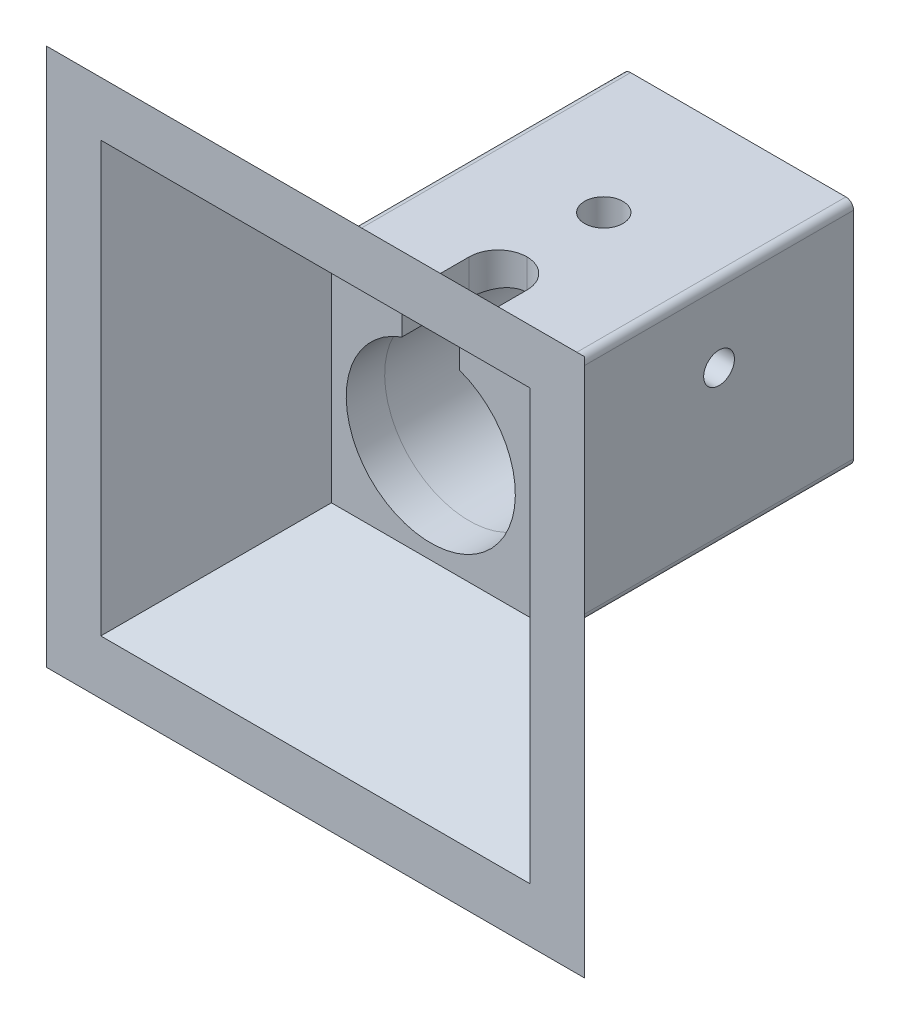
ISO-10303-21;
HEADER;
FILE_DESCRIPTION(('STEP AP214'),'2;1');
FILE_NAME('part.step','',(''),(''),'','','');
FILE_SCHEMA(('AUTOMOTIVE_DESIGN { 1 0 10303 214 1 1 1 1 }'));
ENDSEC;
DATA;
#1=APPLICATION_CONTEXT('core data for automotive mechanical design processes');
#2=APPLICATION_PROTOCOL_DEFINITION('international standard','automotive_design',2000,#1);
#3=PRODUCT_CONTEXT('',#1,'mechanical');
#4=PRODUCT('Part','Part','',(#3));
#5=PRODUCT_RELATED_PRODUCT_CATEGORY('part','',(#4));
#6=PRODUCT_DEFINITION_FORMATION('','',#4);
#7=PRODUCT_DEFINITION_CONTEXT('part definition',#1,'design');
#8=PRODUCT_DEFINITION('design','',#6,#7);
#9=PRODUCT_DEFINITION_SHAPE('','',#8);
#10=(LENGTH_UNIT() NAMED_UNIT(*) SI_UNIT(.MILLI.,.METRE.));
#11=(NAMED_UNIT(*) PLANE_ANGLE_UNIT() SI_UNIT($,.RADIAN.));
#12=(NAMED_UNIT(*) SI_UNIT($,.STERADIAN.) SOLID_ANGLE_UNIT());
#13=UNCERTAINTY_MEASURE_WITH_UNIT(LENGTH_MEASURE(1.E-05),#10,'distance_accuracy_value','');
#14=(GEOMETRIC_REPRESENTATION_CONTEXT(3) GLOBAL_UNCERTAINTY_ASSIGNED_CONTEXT((#13)) GLOBAL_UNIT_ASSIGNED_CONTEXT((#10,
#11,#12)) REPRESENTATION_CONTEXT('',''));
#15=CARTESIAN_POINT('',(0.,0.,0.));
#16=DIRECTION('',(0.,0.,1.));
#17=DIRECTION('',(1.,0.,0.));
#18=AXIS2_PLACEMENT_3D('',#15,#16,#17);
#19=CARTESIAN_POINT('',(0.,38.1,88.9));
#20=DIRECTION('',(0.,0.707106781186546,-0.707106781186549));
#21=DIRECTION('',(0.,0.707106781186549,0.707106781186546));
#22=AXIS2_PLACEMENT_3D('',#19,#20,#21);
#23=PLANE('',#22);
#24=DIRECTION('',(1.,0.,0.));
#25=VECTOR('',#24,1.);
#26=CARTESIAN_POINT('',(0.,52.4478165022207,103.247816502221));
#27=LINE('',#26,#25);
#28=CARTESIAN_POINT('',(9.525,52.4478165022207,103.247816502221));
#29=VERTEX_POINT('',#28);
#30=CARTESIAN_POINT('',(-9.525,52.4478165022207,103.247816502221));
#31=VERTEX_POINT('',#30);
#32=EDGE_CURVE('E153',#29,#31,#27,.F.);
#33=ORIENTED_EDGE('',*,*,#32,.T.);
#34=DIRECTION('',(0.,0.707106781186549,0.707106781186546));
#35=VECTOR('',#34,1.);
#36=CARTESIAN_POINT('',(-9.525,38.1,88.9));
#37=LINE('',#36,#35);
#38=CARTESIAN_POINT('',(-9.525,38.1,88.9));
#39=VERTEX_POINT('',#38);
#40=EDGE_CURVE('E164',#31,#39,#37,.F.);
#41=ORIENTED_EDGE('',*,*,#40,.T.);
#42=DIRECTION('',(-1.,0.,0.));
#43=VECTOR('',#42,1.);
#44=CARTESIAN_POINT('',(0.,38.1,88.9));
#45=LINE('',#44,#43);
#46=CARTESIAN_POINT('',(-38.1,38.1,88.9));
#47=VERTEX_POINT('',#46);
#48=EDGE_CURVE('E197',#39,#47,#45,.T.);
#49=ORIENTED_EDGE('',*,*,#48,.T.);
#50=DIRECTION('',(0.577350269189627,-0.577350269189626,-0.577350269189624));
#51=VECTOR('',#50,1.);
#52=CARTESIAN_POINT('',(-25.4,25.4,76.2));
#53=LINE('',#52,#51);
#54=CARTESIAN_POINT('',(-88.9000000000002,88.9000000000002,139.7));
#55=VERTEX_POINT('',#54);
#56=EDGE_CURVE('E231',#55,#47,#53,.T.);
#57=ORIENTED_EDGE('',*,*,#56,.F.);
#58=DIRECTION('',(1.,0.,0.));
#59=VECTOR('',#58,1.);
#60=CARTESIAN_POINT('',(0.,88.9000000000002,139.7));
#61=LINE('',#60,#59);
#62=CARTESIAN_POINT('',(88.9000000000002,88.9000000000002,139.7));
#63=VERTEX_POINT('',#62);
#64=EDGE_CURVE('E230',#63,#55,#61,.F.);
#65=ORIENTED_EDGE('',*,*,#64,.F.);
#66=DIRECTION('',(0.577350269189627,0.577350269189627,0.577350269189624));
#67=VECTOR('',#66,1.);
#68=CARTESIAN_POINT('',(25.4,25.4,76.2));
#69=LINE('',#68,#67);
#70=CARTESIAN_POINT('',(38.1,38.1,88.9));
#71=VERTEX_POINT('',#70);
#72=EDGE_CURVE('E236',#63,#71,#69,.F.);
#73=ORIENTED_EDGE('',*,*,#72,.T.);
#74=CARTESIAN_POINT('',(9.525,38.1,88.9));
#75=VERTEX_POINT('',#74);
#76=EDGE_CURVE('E173',#71,#75,#45,.T.);
#77=ORIENTED_EDGE('',*,*,#76,.T.);
#78=DIRECTION('',(0.,-0.707106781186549,-0.707106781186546));
#79=VECTOR('',#78,1.);
#80=CARTESIAN_POINT('',(9.525,38.1,88.9));
#81=LINE('',#80,#79);
#82=EDGE_CURVE('E167',#75,#29,#81,.F.);
#83=ORIENTED_EDGE('',*,*,#82,.T.);
#84=EDGE_LOOP('',(#33,#41,#49,#57,#65,#73,#77,#83));
#85=FACE_BOUND('',#84,.T.);
#86=ADVANCED_FACE('F51',(#85),#23,.T.);
#87=CARTESIAN_POINT('',(-38.1,0.,88.9));
#88=DIRECTION('',(-0.707106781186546,0.,-0.707106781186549));
#89=DIRECTION('',(-0.707106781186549,0.,0.707106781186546));
#90=AXIS2_PLACEMENT_3D('',#87,#88,#89);
#91=PLANE('',#90);
#92=DIRECTION('',(0.,-1.,0.));
#93=VECTOR('',#92,1.);
#94=CARTESIAN_POINT('',(-38.1,0.,88.9));
#95=LINE('',#94,#93);
#96=CARTESIAN_POINT('',(-38.1,-38.1,88.9));
#97=VERTEX_POINT('',#96);
#98=EDGE_CURVE('E221',#47,#97,#95,.T.);
#99=ORIENTED_EDGE('',*,*,#98,.T.);
#100=DIRECTION('',(-0.577350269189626,-0.577350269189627,0.577350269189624));
#101=VECTOR('',#100,1.);
#102=CARTESIAN_POINT('',(-25.4,-25.4,76.2));
#103=LINE('',#102,#101);
#104=CARTESIAN_POINT('',(-88.9000000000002,-88.9000000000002,139.7));
#105=VERTEX_POINT('',#104);
#106=EDGE_CURVE('E235',#105,#97,#103,.F.);
#107=ORIENTED_EDGE('',*,*,#106,.F.);
#108=DIRECTION('',(0.,1.,0.));
#109=VECTOR('',#108,1.);
#110=CARTESIAN_POINT('',(-88.9000000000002,0.,139.7));
#111=LINE('',#110,#109);
#112=EDGE_CURVE('E244',#55,#105,#111,.F.);
#113=ORIENTED_EDGE('',*,*,#112,.F.);
#114=ORIENTED_EDGE('',*,*,#56,.T.);
#115=EDGE_LOOP('',(#99,#107,#113,#114));
#116=FACE_BOUND('',#115,.T.);
#117=ADVANCED_FACE('F53',(#116),#91,.T.);
#118=CARTESIAN_POINT('',(0.,-38.1,88.9));
#119=DIRECTION('',(0.,-0.707106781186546,-0.707106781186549));
#120=DIRECTION('',(0.,0.707106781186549,-0.707106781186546));
#121=AXIS2_PLACEMENT_3D('',#118,#119,#120);
#122=PLANE('',#121);
#123=DIRECTION('',(-1.,0.,0.));
#124=VECTOR('',#123,1.);
#125=CARTESIAN_POINT('',(0.,-38.1,88.9));
#126=LINE('',#125,#124);
#127=CARTESIAN_POINT('',(38.1,-38.1,88.9));
#128=VERTEX_POINT('',#127);
#129=EDGE_CURVE('E224',#128,#97,#126,.T.);
#130=ORIENTED_EDGE('',*,*,#129,.F.);
#131=DIRECTION('',(-0.577350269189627,0.577350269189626,-0.577350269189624));
#132=VECTOR('',#131,1.);
#133=CARTESIAN_POINT('',(25.4,-25.4,76.2));
#134=LINE('',#133,#132);
#135=CARTESIAN_POINT('',(88.9000000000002,-88.9000000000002,139.7));
#136=VERTEX_POINT('',#135);
#137=EDGE_CURVE('E238',#136,#128,#134,.T.);
#138=ORIENTED_EDGE('',*,*,#137,.F.);
#139=DIRECTION('',(-1.,0.,0.));
#140=VECTOR('',#139,1.);
#141=CARTESIAN_POINT('',(0.,-88.9000000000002,139.7));
#142=LINE('',#141,#140);
#143=EDGE_CURVE('E246',#136,#105,#142,.T.);
#144=ORIENTED_EDGE('',*,*,#143,.T.);
#145=ORIENTED_EDGE('',*,*,#106,.T.);
#146=EDGE_LOOP('',(#130,#138,#144,#145));
#147=FACE_BOUND('',#146,.T.);
#148=ADVANCED_FACE('F304',(#147),#122,.T.);
#149=CARTESIAN_POINT('',(38.1,0.,88.9));
#150=DIRECTION('',(0.707106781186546,0.,-0.707106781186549));
#151=DIRECTION('',(-0.707106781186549,0.,-0.707106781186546));
#152=AXIS2_PLACEMENT_3D('',#149,#150,#151);
#153=PLANE('',#152);
#154=DIRECTION('',(0.,-1.,0.));
#155=VECTOR('',#154,1.);
#156=CARTESIAN_POINT('',(38.1,0.,88.9));
#157=LINE('',#156,#155);
#158=EDGE_CURVE('E227',#71,#128,#157,.T.);
#159=ORIENTED_EDGE('',*,*,#158,.F.);
#160=ORIENTED_EDGE('',*,*,#72,.F.);
#161=DIRECTION('',(0.,-1.,0.));
#162=VECTOR('',#161,1.);
#163=CARTESIAN_POINT('',(88.9000000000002,0.,139.7));
#164=LINE('',#163,#162);
#165=EDGE_CURVE('E239',#63,#136,#164,.T.);
#166=ORIENTED_EDGE('',*,*,#165,.T.);
#167=ORIENTED_EDGE('',*,*,#137,.T.);
#168=EDGE_LOOP('',(#159,#160,#166,#167));
#169=FACE_BOUND('',#168,.T.);
#170=ADVANCED_FACE('F309',(#169),#153,.T.);
#171=CARTESIAN_POINT('',(0.,0.,139.7));
#172=DIRECTION('',(0.,0.,1.));
#173=DIRECTION('',(1.,0.,0.));
#174=AXIS2_PLACEMENT_3D('',#171,#172,#173);
#175=PLANE('',#174);
#176=DIRECTION('',(1.,0.,0.));
#177=VECTOR('',#176,1.);
#178=CARTESIAN_POINT('',(0.,70.9394877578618,139.7));
#179=LINE('',#178,#177);
#180=CARTESIAN_POINT('',(70.9394877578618,70.9394877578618,139.7));
#181=VERTEX_POINT('',#180);
#182=CARTESIAN_POINT('',(-70.9394877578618,70.9394877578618,139.7));
#183=VERTEX_POINT('',#182);
#184=EDGE_CURVE('E213',#181,#183,#179,.F.);
#185=ORIENTED_EDGE('',*,*,#184,.F.);
#186=DIRECTION('',(0.,-1.,0.));
#187=VECTOR('',#186,1.);
#188=CARTESIAN_POINT('',(70.9394877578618,0.,139.7));
#189=LINE('',#188,#187);
#190=CARTESIAN_POINT('',(70.9394877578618,-70.9394877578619,139.7));
#191=VERTEX_POINT('',#190);
#192=EDGE_CURVE('E202',#181,#191,#189,.T.);
#193=ORIENTED_EDGE('',*,*,#192,.T.);
#194=DIRECTION('',(-1.,0.,0.));
#195=VECTOR('',#194,1.);
#196=CARTESIAN_POINT('',(0.,-70.9394877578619,139.7));
#197=LINE('',#196,#195);
#198=CARTESIAN_POINT('',(-70.9394877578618,-70.9394877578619,139.7));
#199=VERTEX_POINT('',#198);
#200=EDGE_CURVE('E74',#191,#199,#197,.T.);
#201=ORIENTED_EDGE('',*,*,#200,.T.);
#202=DIRECTION('',(0.,1.,0.));
#203=VECTOR('',#202,1.);
#204=CARTESIAN_POINT('',(-70.9394877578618,0.,139.7));
#205=LINE('',#204,#203);
#206=EDGE_CURVE('E215',#183,#199,#205,.F.);
#207=ORIENTED_EDGE('',*,*,#206,.F.);
#208=EDGE_LOOP('',(#185,#193,#201,#207));
#209=FACE_BOUND('',#208,.T.);
#210=ORIENTED_EDGE('',*,*,#64,.T.);
#211=ORIENTED_EDGE('',*,*,#112,.T.);
#212=ORIENTED_EDGE('',*,*,#143,.F.);
#213=ORIENTED_EDGE('',*,*,#165,.F.);
#214=EDGE_LOOP('',(#210,#211,#212,#213));
#215=FACE_BOUND('',#214,.T.);
#216=ADVANCED_FACE('F286',(#209,#215),#175,.T.);
#217=CARTESIAN_POINT('',(0.,0.,88.9));
#218=DIRECTION('',(0.,0.,1.));
#219=DIRECTION('',(1.,0.,0.));
#220=AXIS2_PLACEMENT_3D('',#217,#218,#219);
#221=PLANE('',#220);
#222=ORIENTED_EDGE('',*,*,#48,.F.);
#223=DIRECTION('',(0.,-1.,0.));
#224=VECTOR('',#223,1.);
#225=CARTESIAN_POINT('',(-9.525,0.,88.9));
#226=LINE('',#225,#224);
#227=CARTESIAN_POINT('',(-9.525,26.266289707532,88.9));
#228=VERTEX_POINT('',#227);
#229=EDGE_CURVE('E182',#39,#228,#226,.T.);
#230=ORIENTED_EDGE('',*,*,#229,.T.);
#231=CARTESIAN_POINT('',(0.,0.,88.9));
#232=DIRECTION('',(0.,0.,1.));
#233=DIRECTION('',(1.,0.,0.));
#234=AXIS2_PLACEMENT_3D('',#231,#232,#233);
#235=CIRCLE('',#234,27.94);
#236=CARTESIAN_POINT('',(9.525,26.266289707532,88.9));
#237=VERTEX_POINT('',#236);
#238=EDGE_CURVE('E186',#237,#228,#235,.F.);
#239=ORIENTED_EDGE('',*,*,#238,.F.);
#240=DIRECTION('',(0.,1.,0.));
#241=VECTOR('',#240,1.);
#242=CARTESIAN_POINT('',(9.52500000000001,0.,88.9));
#243=LINE('',#242,#241);
#244=EDGE_CURVE('E66',#237,#75,#243,.T.);
#245=ORIENTED_EDGE('',*,*,#244,.T.);
#246=ORIENTED_EDGE('',*,*,#76,.F.);
#247=ORIENTED_EDGE('',*,*,#158,.T.);
#248=ORIENTED_EDGE('',*,*,#129,.T.);
#249=ORIENTED_EDGE('',*,*,#98,.F.);
#250=EDGE_LOOP('',(#222,#230,#239,#245,#246,#247,#248,#249));
#251=FACE_BOUND('',#250,.T.);
#252=ADVANCED_FACE('F262',(#251),#221,.F.);
#253=CARTESIAN_POINT('',(0.,29.1197438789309,97.8802561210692));
#254=DIRECTION('',(0.,0.707106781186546,-0.707106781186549));
#255=DIRECTION('',(0.,0.707106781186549,0.707106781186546));
#256=AXIS2_PLACEMENT_3D('',#253,#254,#255);
#257=PLANE('',#256);
#258=DIRECTION('',(0.,0.707106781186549,0.707106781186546));
#259=VECTOR('',#258,1.);
#260=CARTESIAN_POINT('',(-9.525,29.1197438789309,97.8802561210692));
#261=LINE('',#260,#259);
#262=CARTESIAN_POINT('',(-9.525,52.4478165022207,121.208328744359));
#263=VERTEX_POINT('',#262);
#264=CARTESIAN_POINT('',(-9.525,32.8394877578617,101.6));
#265=VERTEX_POINT('',#264);
#266=EDGE_CURVE('E176',#263,#265,#261,.F.);
#267=ORIENTED_EDGE('',*,*,#266,.F.);
#268=DIRECTION('',(1.,0.,0.));
#269=VECTOR('',#268,1.);
#270=CARTESIAN_POINT('',(0.,52.4478165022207,121.208328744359));
#271=LINE('',#270,#269);
#272=CARTESIAN_POINT('',(9.525,52.4478165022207,121.208328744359));
#273=VERTEX_POINT('',#272);
#274=EDGE_CURVE('E12',#273,#263,#271,.F.);
#275=ORIENTED_EDGE('',*,*,#274,.F.);
#276=DIRECTION('',(0.,-0.707106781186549,-0.707106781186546));
#277=VECTOR('',#276,1.);
#278=CARTESIAN_POINT('',(9.525,29.1197438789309,97.8802561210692));
#279=LINE('',#278,#277);
#280=CARTESIAN_POINT('',(9.525,32.8394877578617,101.6));
#281=VERTEX_POINT('',#280);
#282=EDGE_CURVE('E169',#281,#273,#279,.F.);
#283=ORIENTED_EDGE('',*,*,#282,.F.);
#284=DIRECTION('',(1.,0.,0.));
#285=VECTOR('',#284,1.);
#286=CARTESIAN_POINT('',(0.,32.8394877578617,101.6));
#287=LINE('',#286,#285);
#288=CARTESIAN_POINT('',(32.8394877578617,32.8394877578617,101.6));
#289=VERTEX_POINT('',#288);
#290=EDGE_CURVE('E190',#289,#281,#287,.F.);
#291=ORIENTED_EDGE('',*,*,#290,.F.);
#292=DIRECTION('',(0.577350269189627,0.577350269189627,0.577350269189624));
#293=VECTOR('',#292,1.);
#294=CARTESIAN_POINT('',(19.4131625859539,19.4131625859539,88.1736748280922));
#295=LINE('',#294,#293);
#296=EDGE_CURVE('E199',#181,#289,#295,.F.);
#297=ORIENTED_EDGE('',*,*,#296,.F.);
#298=ORIENTED_EDGE('',*,*,#184,.T.);
#299=DIRECTION('',(0.577350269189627,-0.577350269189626,-0.577350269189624));
#300=VECTOR('',#299,1.);
#301=CARTESIAN_POINT('',(-19.4131625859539,19.4131625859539,88.1736748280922));
#302=LINE('',#301,#300);
#303=CARTESIAN_POINT('',(-32.8394877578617,32.8394877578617,101.6));
#304=VERTEX_POINT('',#303);
#305=EDGE_CURVE('E194',#183,#304,#302,.T.);
#306=ORIENTED_EDGE('',*,*,#305,.T.);
#307=EDGE_CURVE('E189',#265,#304,#287,.F.);
#308=ORIENTED_EDGE('',*,*,#307,.F.);
#309=EDGE_LOOP('',(#267,#275,#283,#291,#297,#298,#306,#308));
#310=FACE_BOUND('',#309,.T.);
#311=ADVANCED_FACE('F276',(#310),#257,.F.);
#312=CARTESIAN_POINT('',(-29.1197438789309,0.,97.8802561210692));
#313=DIRECTION('',(-0.707106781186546,0.,-0.707106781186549));
#314=DIRECTION('',(-0.707106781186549,0.,0.707106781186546));
#315=AXIS2_PLACEMENT_3D('',#312,#313,#314);
#316=PLANE('',#315);
#317=DIRECTION('',(0.,1.,0.));
#318=VECTOR('',#317,1.);
#319=CARTESIAN_POINT('',(-32.8394877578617,0.,101.6));
#320=LINE('',#319,#318);
#321=CARTESIAN_POINT('',(-32.8394877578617,-32.8394877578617,101.6));
#322=VERTEX_POINT('',#321);
#323=EDGE_CURVE('E193',#304,#322,#320,.F.);
#324=ORIENTED_EDGE('',*,*,#323,.F.);
#325=ORIENTED_EDGE('',*,*,#305,.F.);
#326=ORIENTED_EDGE('',*,*,#206,.T.);
#327=DIRECTION('',(-0.577350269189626,-0.577350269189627,0.577350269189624));
#328=VECTOR('',#327,1.);
#329=CARTESIAN_POINT('',(-19.4131625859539,-19.4131625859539,88.1736748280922));
#330=LINE('',#329,#328);
#331=EDGE_CURVE('E198',#199,#322,#330,.F.);
#332=ORIENTED_EDGE('',*,*,#331,.T.);
#333=EDGE_LOOP('',(#324,#325,#326,#332));
#334=FACE_BOUND('',#333,.T.);
#335=ADVANCED_FACE('F281',(#334),#316,.F.);
#336=CARTESIAN_POINT('',(0.,-29.1197438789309,97.8802561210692));
#337=DIRECTION('',(0.,-0.707106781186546,-0.707106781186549));
#338=DIRECTION('',(0.,0.707106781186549,-0.707106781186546));
#339=AXIS2_PLACEMENT_3D('',#336,#337,#338);
#340=PLANE('',#339);
#341=DIRECTION('',(-1.,0.,0.));
#342=VECTOR('',#341,1.);
#343=CARTESIAN_POINT('',(0.,-32.8394877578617,101.6));
#344=LINE('',#343,#342);
#345=CARTESIAN_POINT('',(32.8394877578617,-32.8394877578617,101.6));
#346=VERTEX_POINT('',#345);
#347=EDGE_CURVE('E205',#346,#322,#344,.T.);
#348=ORIENTED_EDGE('',*,*,#347,.T.);
#349=ORIENTED_EDGE('',*,*,#331,.F.);
#350=ORIENTED_EDGE('',*,*,#200,.F.);
#351=DIRECTION('',(-0.577350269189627,0.577350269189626,-0.577350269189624));
#352=VECTOR('',#351,1.);
#353=CARTESIAN_POINT('',(19.4131625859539,-19.4131625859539,88.1736748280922));
#354=LINE('',#353,#352);
#355=EDGE_CURVE('E201',#191,#346,#354,.T.);
#356=ORIENTED_EDGE('',*,*,#355,.T.);
#357=EDGE_LOOP('',(#348,#349,#350,#356));
#358=FACE_BOUND('',#357,.T.);
#359=ADVANCED_FACE('F283',(#358),#340,.F.);
#360=CARTESIAN_POINT('',(29.1197438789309,0.,97.8802561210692));
#361=DIRECTION('',(0.707106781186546,0.,-0.707106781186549));
#362=DIRECTION('',(-0.707106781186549,0.,-0.707106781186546));
#363=AXIS2_PLACEMENT_3D('',#360,#361,#362);
#364=PLANE('',#363);
#365=DIRECTION('',(0.,-1.,0.));
#366=VECTOR('',#365,1.);
#367=CARTESIAN_POINT('',(32.8394877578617,0.,101.6));
#368=LINE('',#367,#366);
#369=EDGE_CURVE('E209',#289,#346,#368,.T.);
#370=ORIENTED_EDGE('',*,*,#369,.T.);
#371=ORIENTED_EDGE('',*,*,#355,.F.);
#372=ORIENTED_EDGE('',*,*,#192,.F.);
#373=ORIENTED_EDGE('',*,*,#296,.T.);
#374=EDGE_LOOP('',(#370,#371,#372,#373));
#375=FACE_BOUND('',#374,.T.);
#376=ADVANCED_FACE('F290',(#375),#364,.F.);
#377=CARTESIAN_POINT('',(0.,0.,101.6));
#378=DIRECTION('',(0.,0.,1.));
#379=DIRECTION('',(1.,0.,0.));
#380=AXIS2_PLACEMENT_3D('',#377,#378,#379);
#381=PLANE('',#380);
#382=DIRECTION('',(0.,-1.,0.));
#383=VECTOR('',#382,1.);
#384=CARTESIAN_POINT('',(-9.525,0.,101.6));
#385=LINE('',#384,#383);
#386=CARTESIAN_POINT('',(-9.525,26.266289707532,101.6));
#387=VERTEX_POINT('',#386);
#388=EDGE_CURVE('E174',#265,#387,#385,.T.);
#389=ORIENTED_EDGE('',*,*,#388,.F.);
#390=ORIENTED_EDGE('',*,*,#307,.T.);
#391=ORIENTED_EDGE('',*,*,#323,.T.);
#392=ORIENTED_EDGE('',*,*,#347,.F.);
#393=ORIENTED_EDGE('',*,*,#369,.F.);
#394=ORIENTED_EDGE('',*,*,#290,.T.);
#395=DIRECTION('',(0.,1.,0.));
#396=VECTOR('',#395,1.);
#397=CARTESIAN_POINT('',(9.52500000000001,0.,101.6));
#398=LINE('',#397,#396);
#399=CARTESIAN_POINT('',(9.525,26.266289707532,101.6));
#400=VERTEX_POINT('',#399);
#401=EDGE_CURVE('E266',#400,#281,#398,.T.);
#402=ORIENTED_EDGE('',*,*,#401,.F.);
#403=CARTESIAN_POINT('',(0.,0.,101.6));
#404=DIRECTION('',(0.,0.,1.));
#405=DIRECTION('',(1.,0.,0.));
#406=AXIS2_PLACEMENT_3D('',#403,#404,#405);
#407=CIRCLE('',#406,27.94);
#408=EDGE_CURVE('E163',#400,#387,#407,.F.);
#409=ORIENTED_EDGE('',*,*,#408,.T.);
#410=EDGE_LOOP('',(#389,#390,#391,#392,#393,#394,#402,#409));
#411=FACE_BOUND('',#410,.T.);
#412=ADVANCED_FACE('F268',(#411),#381,.T.);
#413=CARTESIAN_POINT('',(0.,0.,139.7));
#414=DIRECTION('',(0.,0.,-1.));
#415=DIRECTION('',(-1.,0.,0.));
#416=AXIS2_PLACEMENT_3D('',#413,#414,#415);
#417=CYLINDRICAL_SURFACE('',#416,27.94);
#418=DIRECTION('',(0.,0.,-1.));
#419=VECTOR('',#418,1.);
#420=CARTESIAN_POINT('',(-9.525,26.266289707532,139.7));
#421=LINE('',#420,#419);
#422=EDGE_CURVE('E59',#387,#228,#421,.T.);
#423=ORIENTED_EDGE('',*,*,#422,.F.);
#424=ORIENTED_EDGE('',*,*,#408,.F.);
#425=DIRECTION('',(0.,0.,-1.));
#426=VECTOR('',#425,1.);
#427=CARTESIAN_POINT('',(9.525,26.266289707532,139.7));
#428=LINE('',#427,#426);
#429=EDGE_CURVE('E234',#237,#400,#428,.F.);
#430=ORIENTED_EDGE('',*,*,#429,.F.);
#431=ORIENTED_EDGE('',*,*,#238,.T.);
#432=EDGE_LOOP('',(#423,#424,#430,#431));
#433=FACE_BOUND('',#432,.T.);
#434=ADVANCED_FACE('F264',(#433),#417,.F.);
#435=CARTESIAN_POINT('',(9.525,52.4478165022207,69.85));
#436=DIRECTION('',(0.,1.,0.));
#437=DIRECTION('',(0.,0.,1.));
#438=AXIS2_PLACEMENT_3D('',#435,#436,#437);
#439=PLANE('',#438);
#440=DIRECTION('',(0.,0.,1.));
#441=VECTOR('',#440,1.);
#442=CARTESIAN_POINT('',(9.525,52.4478165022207,69.85));
#443=LINE('',#442,#441);
#444=EDGE_CURVE('E156',#29,#273,#443,.T.);
#445=ORIENTED_EDGE('',*,*,#444,.T.);
#446=ORIENTED_EDGE('',*,*,#274,.T.);
#447=DIRECTION('',(0.,0.,1.));
#448=VECTOR('',#447,1.);
#449=CARTESIAN_POINT('',(-9.525,52.4478165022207,69.85));
#450=LINE('',#449,#448);
#451=EDGE_CURVE('E159',#31,#263,#450,.T.);
#452=ORIENTED_EDGE('',*,*,#451,.F.);
#453=ORIENTED_EDGE('',*,*,#32,.F.);
#454=EDGE_LOOP('',(#445,#446,#452,#453));
#455=FACE_BOUND('',#454,.T.);
#456=ADVANCED_FACE('F155',(#455),#439,.F.);
#457=CARTESIAN_POINT('',(-9.525,52.4478165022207,69.85));
#458=DIRECTION('',(-1.,0.,0.));
#459=DIRECTION('',(0.,-1.,0.));
#460=AXIS2_PLACEMENT_3D('',#457,#458,#459);
#461=PLANE('',#460);
#462=ORIENTED_EDGE('',*,*,#451,.T.);
#463=ORIENTED_EDGE('',*,*,#266,.T.);
#464=ORIENTED_EDGE('',*,*,#388,.T.);
#465=ORIENTED_EDGE('',*,*,#422,.T.);
#466=ORIENTED_EDGE('',*,*,#229,.F.);
#467=ORIENTED_EDGE('',*,*,#40,.F.);
#468=EDGE_LOOP('',(#462,#463,#464,#465,#466,#467));
#469=FACE_BOUND('',#468,.T.);
#470=ADVANCED_FACE('F255',(#469),#461,.F.);
#471=CARTESIAN_POINT('',(9.525,52.4478165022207,69.85));
#472=DIRECTION('',(1.,0.,0.));
#473=DIRECTION('',(0.,1.,0.));
#474=AXIS2_PLACEMENT_3D('',#471,#472,#473);
#475=PLANE('',#474);
#476=ORIENTED_EDGE('',*,*,#244,.F.);
#477=ORIENTED_EDGE('',*,*,#429,.T.);
#478=ORIENTED_EDGE('',*,*,#401,.T.);
#479=ORIENTED_EDGE('',*,*,#282,.T.);
#480=ORIENTED_EDGE('',*,*,#444,.F.);
#481=ORIENTED_EDGE('',*,*,#82,.F.);
#482=EDGE_LOOP('',(#476,#477,#478,#479,#480,#481));
#483=FACE_BOUND('',#482,.T.);
#484=ADVANCED_FACE('F166',(#483),#475,.F.);
#485=CLOSED_SHELL('',(#86,#117,#148,#170,#216,#252,#311,#335,#359,#376,#412,#434,#456,#470,#484));
#486=MANIFOLD_SOLID_BREP('B2',#485);
#487=CARTESIAN_POINT('',(38.1,-38.1,88.9));
#488=DIRECTION('',(0.,-1.,0.));
#489=DIRECTION('',(1.,0.,0.));
#490=AXIS2_PLACEMENT_3D('',#487,#488,#489);
#491=PLANE('',#490);
#492=DIRECTION('',(-1.,0.,0.));
#493=VECTOR('',#492,1.);
#494=CARTESIAN_POINT('',(38.1,-38.1,0.));
#495=LINE('',#494,#493);
#496=CARTESIAN_POINT('',(35.56,-38.1,0.));
#497=VERTEX_POINT('',#496);
#498=CARTESIAN_POINT('',(-35.56,-38.1,0.));
#499=VERTEX_POINT('',#498);
#500=EDGE_CURVE('E558',#497,#499,#495,.T.);
#501=ORIENTED_EDGE('',*,*,#500,.F.);
#502=DIRECTION('',(0.,0.,-1.));
#503=VECTOR('',#502,1.);
#504=CARTESIAN_POINT('',(35.56,-38.1,88.9));
#505=LINE('',#504,#503);
#506=CARTESIAN_POINT('',(35.56,-38.1,88.9));
#507=VERTEX_POINT('',#506);
#508=EDGE_CURVE('E698',#497,#507,#505,.F.);
#509=ORIENTED_EDGE('',*,*,#508,.T.);
#510=DIRECTION('',(-1.,0.,0.));
#511=VECTOR('',#510,1.);
#512=CARTESIAN_POINT('',(38.1,-38.1,88.9));
#513=LINE('',#512,#511);
#514=CARTESIAN_POINT('',(-35.56,-38.1,88.9));
#515=VERTEX_POINT('',#514);
#516=EDGE_CURVE('E569',#507,#515,#513,.T.);
#517=ORIENTED_EDGE('',*,*,#516,.T.);
#518=DIRECTION('',(0.,0.,-1.));
#519=VECTOR('',#518,1.);
#520=CARTESIAN_POINT('',(-35.56,-38.1,0.));
#521=LINE('',#520,#519);
#522=EDGE_CURVE('E700',#515,#499,#521,.T.);
#523=ORIENTED_EDGE('',*,*,#522,.T.);
#524=EDGE_LOOP('',(#501,#509,#517,#523));
#525=FACE_BOUND('',#524,.T.);
#526=ADVANCED_FACE('F435',(#525),#491,.T.);
#527=CARTESIAN_POINT('',(38.1,38.1,88.9));
#528=DIRECTION('',(1.,0.,0.));
#529=DIRECTION('',(0.,0.,-1.));
#530=AXIS2_PLACEMENT_3D('',#527,#528,#529);
#531=PLANE('',#530);
#532=CARTESIAN_POINT('',(38.1,12.7,44.45));
#533=DIRECTION('',(1.,0.,0.));
#534=DIRECTION('',(0.,0.,-1.));
#535=AXIS2_PLACEMENT_3D('',#532,#533,#534);
#536=CIRCLE('',#535,5.08);
#537=CARTESIAN_POINT('',(38.1,12.7,39.37));
#538=VERTEX_POINT('',#537);
#539=EDGE_CURVE('E598',#538,#538,#536,.T.);
#540=ORIENTED_EDGE('',*,*,#539,.F.);
#541=EDGE_LOOP('',(#540));
#542=FACE_BOUND('',#541,.T.);
#543=DIRECTION('',(0.,-1.,0.));
#544=VECTOR('',#543,1.);
#545=CARTESIAN_POINT('',(38.1,38.1,88.9));
#546=LINE('',#545,#544);
#547=CARTESIAN_POINT('',(38.1,35.56,88.9));
#548=VERTEX_POINT('',#547);
#549=CARTESIAN_POINT('',(38.1,-35.56,88.9));
#550=VERTEX_POINT('',#549);
#551=EDGE_CURVE('E540',#548,#550,#546,.T.);
#552=ORIENTED_EDGE('',*,*,#551,.T.);
#553=DIRECTION('',(0.,0.,-1.));
#554=VECTOR('',#553,1.);
#555=CARTESIAN_POINT('',(38.1,-35.56,88.9));
#556=LINE('',#555,#554);
#557=CARTESIAN_POINT('',(38.1,-35.56,0.));
#558=VERTEX_POINT('',#557);
#559=EDGE_CURVE('E711',#550,#558,#556,.T.);
#560=ORIENTED_EDGE('',*,*,#559,.T.);
#561=DIRECTION('',(0.,-1.,0.));
#562=VECTOR('',#561,1.);
#563=CARTESIAN_POINT('',(38.1,38.1,0.));
#564=LINE('',#563,#562);
#565=CARTESIAN_POINT('',(38.1,35.56,0.));
#566=VERTEX_POINT('',#565);
#567=EDGE_CURVE('E573',#566,#558,#564,.T.);
#568=ORIENTED_EDGE('',*,*,#567,.F.);
#569=DIRECTION('',(0.,0.,-1.));
#570=VECTOR('',#569,1.);
#571=CARTESIAN_POINT('',(38.1,35.56,88.9));
#572=LINE('',#571,#570);
#573=EDGE_CURVE('E588',#566,#548,#572,.F.);
#574=ORIENTED_EDGE('',*,*,#573,.T.);
#575=EDGE_LOOP('',(#552,#560,#568,#574));
#576=FACE_BOUND('',#575,.T.);
#577=ADVANCED_FACE('F627',(#542,#576),#531,.T.);
#578=CARTESIAN_POINT('',(38.1,38.1,88.9));
#579=DIRECTION('',(0.,-1.,0.));
#580=DIRECTION('',(0.,0.,-1.));
#581=AXIS2_PLACEMENT_3D('',#578,#579,#580);
#582=PLANE('',#581);
#583=CARTESIAN_POINT('',(0.,38.1,44.45));
#584=DIRECTION('',(0.,1.,0.));
#585=DIRECTION('',(0.,0.,1.));
#586=AXIS2_PLACEMENT_3D('',#583,#584,#585);
#587=CIRCLE('',#586,6.35);
#588=CARTESIAN_POINT('',(0.,38.1,50.8));
#589=VERTEX_POINT('',#588);
#590=EDGE_CURVE('E742',#589,#589,#587,.T.);
#591=ORIENTED_EDGE('',*,*,#590,.F.);
#592=EDGE_LOOP('',(#591));
#593=FACE_BOUND('',#592,.T.);
#594=DIRECTION('',(-1.,0.,0.));
#595=VECTOR('',#594,1.);
#596=CARTESIAN_POINT('',(38.1,38.1,88.9));
#597=LINE('',#596,#595);
#598=CARTESIAN_POINT('',(35.56,38.1,88.9));
#599=VERTEX_POINT('',#598);
#600=CARTESIAN_POINT('',(9.525,38.1,88.9));
#601=VERTEX_POINT('',#600);
#602=EDGE_CURVE('E550',#599,#601,#597,.T.);
#603=ORIENTED_EDGE('',*,*,#602,.F.);
#604=DIRECTION('',(0.,0.,-1.));
#605=VECTOR('',#604,1.);
#606=CARTESIAN_POINT('',(35.56,38.1,0.));
#607=LINE('',#606,#605);
#608=CARTESIAN_POINT('',(35.56,38.1,0.));
#609=VERTEX_POINT('',#608);
#610=EDGE_CURVE('E678',#599,#609,#607,.T.);
#611=ORIENTED_EDGE('',*,*,#610,.T.);
#612=DIRECTION('',(-1.,0.,0.));
#613=VECTOR('',#612,1.);
#614=CARTESIAN_POINT('',(38.1,38.1,0.));
#615=LINE('',#614,#613);
#616=CARTESIAN_POINT('',(-35.56,38.1,0.));
#617=VERTEX_POINT('',#616);
#618=EDGE_CURVE('E582',#609,#617,#615,.T.);
#619=ORIENTED_EDGE('',*,*,#618,.T.);
#620=DIRECTION('',(0.,0.,-1.));
#621=VECTOR('',#620,1.);
#622=CARTESIAN_POINT('',(-35.56,38.1,88.9));
#623=LINE('',#622,#621);
#624=CARTESIAN_POINT('',(-35.56,38.1,88.9));
#625=VERTEX_POINT('',#624);
#626=EDGE_CURVE('E683',#617,#625,#623,.F.);
#627=ORIENTED_EDGE('',*,*,#626,.T.);
#628=CARTESIAN_POINT('',(-9.525,38.1,88.9));
#629=VERTEX_POINT('',#628);
#630=EDGE_CURVE('E576',#629,#625,#597,.T.);
#631=ORIENTED_EDGE('',*,*,#630,.F.);
#632=DIRECTION('',(0.,0.,-1.));
#633=VECTOR('',#632,1.);
#634=CARTESIAN_POINT('',(-9.525,38.1,88.9));
#635=LINE('',#634,#633);
#636=CARTESIAN_POINT('',(-9.525,38.1,79.375));
#637=VERTEX_POINT('',#636);
#638=EDGE_CURVE('E565',#629,#637,#635,.T.);
#639=ORIENTED_EDGE('',*,*,#638,.T.);
#640=CARTESIAN_POINT('',(0.,38.1,79.375));
#641=DIRECTION('',(0.,-1.,0.));
#642=DIRECTION('',(0.,0.,-1.));
#643=AXIS2_PLACEMENT_3D('',#640,#641,#642);
#644=CIRCLE('',#643,9.525);
#645=CARTESIAN_POINT('',(0.,38.1,69.85));
#646=VERTEX_POINT('',#645);
#647=EDGE_CURVE('E49',#637,#646,#644,.T.);
#648=ORIENTED_EDGE('',*,*,#647,.T.);
#649=CARTESIAN_POINT('',(0.,38.1,79.375));
#650=DIRECTION('',(0.,-1.,0.));
#651=DIRECTION('',(0.,0.,-1.));
#652=AXIS2_PLACEMENT_3D('',#649,#650,#651);
#653=CIRCLE('',#652,9.525);
#654=CARTESIAN_POINT('',(9.525,38.1,79.375));
#655=VERTEX_POINT('',#654);
#656=EDGE_CURVE('E667',#646,#655,#653,.T.);
#657=ORIENTED_EDGE('',*,*,#656,.T.);
#658=DIRECTION('',(0.,0.,1.));
#659=VECTOR('',#658,1.);
#660=CARTESIAN_POINT('',(9.525,38.1,88.9));
#661=LINE('',#660,#659);
#662=EDGE_CURVE('E551',#655,#601,#661,.T.);
#663=ORIENTED_EDGE('',*,*,#662,.T.);
#664=EDGE_LOOP('',(#603,#611,#619,#627,#631,#639,#648,#657,#663));
#665=FACE_BOUND('',#664,.T.);
#666=ADVANCED_FACE('F633',(#593,#665),#582,.F.);
#667=CARTESIAN_POINT('',(-38.1,38.1,88.9));
#668=DIRECTION('',(1.,0.,0.));
#669=DIRECTION('',(0.,1.,0.));
#670=AXIS2_PLACEMENT_3D('',#667,#668,#669);
#671=PLANE('',#670);
#672=CARTESIAN_POINT('',(-38.1,12.7,44.45));
#673=DIRECTION('',(1.,0.,0.));
#674=DIRECTION('',(0.,1.,0.));
#675=AXIS2_PLACEMENT_3D('',#672,#673,#674);
#676=CIRCLE('',#675,5.08);
#677=CARTESIAN_POINT('',(-38.1,17.78,44.45));
#678=VERTEX_POINT('',#677);
#679=EDGE_CURVE('E552',#678,#678,#676,.T.);
#680=ORIENTED_EDGE('',*,*,#679,.T.);
#681=EDGE_LOOP('',(#680));
#682=FACE_BOUND('',#681,.T.);
#683=DIRECTION('',(0.,-1.,0.));
#684=VECTOR('',#683,1.);
#685=CARTESIAN_POINT('',(-38.1,38.1,0.));
#686=LINE('',#685,#684);
#687=CARTESIAN_POINT('',(-38.1,35.56,0.));
#688=VERTEX_POINT('',#687);
#689=CARTESIAN_POINT('',(-38.1,-35.56,0.));
#690=VERTEX_POINT('',#689);
#691=EDGE_CURVE('E562',#688,#690,#686,.T.);
#692=ORIENTED_EDGE('',*,*,#691,.T.);
#693=DIRECTION('',(0.,0.,-1.));
#694=VECTOR('',#693,1.);
#695=CARTESIAN_POINT('',(-38.1,-35.56,88.9));
#696=LINE('',#695,#694);
#697=CARTESIAN_POINT('',(-38.1,-35.56,88.9));
#698=VERTEX_POINT('',#697);
#699=EDGE_CURVE('E685',#690,#698,#696,.F.);
#700=ORIENTED_EDGE('',*,*,#699,.T.);
#701=DIRECTION('',(0.,-1.,0.));
#702=VECTOR('',#701,1.);
#703=CARTESIAN_POINT('',(-38.1,38.1,88.9));
#704=LINE('',#703,#702);
#705=CARTESIAN_POINT('',(-38.1,35.56,88.9));
#706=VERTEX_POINT('',#705);
#707=EDGE_CURVE('E572',#706,#698,#704,.T.);
#708=ORIENTED_EDGE('',*,*,#707,.F.);
#709=DIRECTION('',(0.,0.,-1.));
#710=VECTOR('',#709,1.);
#711=CARTESIAN_POINT('',(-38.1,35.56,88.9));
#712=LINE('',#711,#710);
#713=EDGE_CURVE('E687',#706,#688,#712,.T.);
#714=ORIENTED_EDGE('',*,*,#713,.T.);
#715=EDGE_LOOP('',(#692,#700,#708,#714));
#716=FACE_BOUND('',#715,.T.);
#717=ADVANCED_FACE('F639',(#682,#716),#671,.F.);
#718=CARTESIAN_POINT('',(0.,0.,88.9));
#719=DIRECTION('',(0.,0.,1.));
#720=DIRECTION('',(1.,0.,0.));
#721=AXIS2_PLACEMENT_3D('',#718,#719,#720);
#722=PLANE('',#721);
#723=ORIENTED_EDGE('',*,*,#516,.F.);
#724=CARTESIAN_POINT('',(35.56,-35.56,88.9));
#725=DIRECTION('',(0.,0.,1.));
#726=DIRECTION('',(1.,0.,0.));
#727=AXIS2_PLACEMENT_3D('',#724,#725,#726);
#728=CIRCLE('',#727,2.54);
#729=EDGE_CURVE('E690',#507,#550,#728,.T.);
#730=ORIENTED_EDGE('',*,*,#729,.T.);
#731=ORIENTED_EDGE('',*,*,#551,.F.);
#732=CARTESIAN_POINT('',(35.56,35.56,88.9));
#733=DIRECTION('',(0.,0.,1.));
#734=DIRECTION('',(1.,0.,0.));
#735=AXIS2_PLACEMENT_3D('',#732,#733,#734);
#736=CIRCLE('',#735,2.54);
#737=EDGE_CURVE('E694',#548,#599,#736,.T.);
#738=ORIENTED_EDGE('',*,*,#737,.T.);
#739=ORIENTED_EDGE('',*,*,#602,.T.);
#740=DIRECTION('',(0.,1.,0.));
#741=VECTOR('',#740,1.);
#742=CARTESIAN_POINT('',(9.52500000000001,0.,88.9));
#743=LINE('',#742,#741);
#744=CARTESIAN_POINT('',(9.525,26.266289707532,88.9));
#745=VERTEX_POINT('',#744);
#746=EDGE_CURVE('E535',#745,#601,#743,.T.);
#747=ORIENTED_EDGE('',*,*,#746,.F.);
#748=CARTESIAN_POINT('',(0.,0.,88.9));
#749=DIRECTION('',(0.,0.,1.));
#750=DIRECTION('',(1.,0.,0.));
#751=AXIS2_PLACEMENT_3D('',#748,#749,#750);
#752=CIRCLE('',#751,27.94);
#753=CARTESIAN_POINT('',(-9.525,26.266289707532,88.9));
#754=VERTEX_POINT('',#753);
#755=EDGE_CURVE('E548',#745,#754,#752,.F.);
#756=ORIENTED_EDGE('',*,*,#755,.T.);
#757=DIRECTION('',(0.,-1.,0.));
#758=VECTOR('',#757,1.);
#759=CARTESIAN_POINT('',(-9.525,0.,88.9));
#760=LINE('',#759,#758);
#761=EDGE_CURVE('E677',#629,#754,#760,.T.);
#762=ORIENTED_EDGE('',*,*,#761,.F.);
#763=ORIENTED_EDGE('',*,*,#630,.T.);
#764=CARTESIAN_POINT('',(-35.56,35.56,88.9));
#765=DIRECTION('',(0.,0.,1.));
#766=DIRECTION('',(1.,0.,0.));
#767=AXIS2_PLACEMENT_3D('',#764,#765,#766);
#768=CIRCLE('',#767,2.54);
#769=EDGE_CURVE('E696',#625,#706,#768,.T.);
#770=ORIENTED_EDGE('',*,*,#769,.T.);
#771=ORIENTED_EDGE('',*,*,#707,.T.);
#772=CARTESIAN_POINT('',(-35.56,-35.56,88.9));
#773=DIRECTION('',(0.,0.,1.));
#774=DIRECTION('',(1.,0.,0.));
#775=AXIS2_PLACEMENT_3D('',#772,#773,#774);
#776=CIRCLE('',#775,2.54);
#777=EDGE_CURVE('E692',#698,#515,#776,.T.);
#778=ORIENTED_EDGE('',*,*,#777,.T.);
#779=EDGE_LOOP('',(#723,#730,#731,#738,#739,#747,#756,#762,#763,#770,#771,#778));
#780=FACE_BOUND('',#779,.T.);
#781=ADVANCED_FACE('F546',(#780),#722,.T.);
#782=CARTESIAN_POINT('',(0.,0.,0.));
#783=DIRECTION('',(0.,0.,1.));
#784=DIRECTION('',(1.,0.,0.));
#785=AXIS2_PLACEMENT_3D('',#782,#783,#784);
#786=PLANE('',#785);
#787=CARTESIAN_POINT('',(0.,0.,0.));
#788=DIRECTION('',(0.,0.,1.));
#789=DIRECTION('',(1.,0.,0.));
#790=AXIS2_PLACEMENT_3D('',#787,#788,#789);
#791=CIRCLE('',#790,27.94);
#792=CARTESIAN_POINT('',(27.94,0.,0.));
#793=VERTEX_POINT('',#792);
#794=EDGE_CURVE('E559',#793,#793,#791,.T.);
#795=ORIENTED_EDGE('',*,*,#794,.T.);
#796=EDGE_LOOP('',(#795));
#797=FACE_BOUND('',#796,.T.);
#798=ORIENTED_EDGE('',*,*,#567,.T.);
#799=CARTESIAN_POINT('',(35.56,-35.56,0.));
#800=DIRECTION('',(0.,0.,1.));
#801=DIRECTION('',(1.,0.,0.));
#802=AXIS2_PLACEMENT_3D('',#799,#800,#801);
#803=CIRCLE('',#802,2.54);
#804=EDGE_CURVE('E703',#558,#497,#803,.F.);
#805=ORIENTED_EDGE('',*,*,#804,.T.);
#806=ORIENTED_EDGE('',*,*,#500,.T.);
#807=CARTESIAN_POINT('',(-35.56,-35.56,0.));
#808=DIRECTION('',(0.,0.,1.));
#809=DIRECTION('',(1.,0.,0.));
#810=AXIS2_PLACEMENT_3D('',#807,#808,#809);
#811=CIRCLE('',#810,2.54);
#812=EDGE_CURVE('E705',#499,#690,#811,.F.);
#813=ORIENTED_EDGE('',*,*,#812,.T.);
#814=ORIENTED_EDGE('',*,*,#691,.F.);
#815=CARTESIAN_POINT('',(-35.56,35.56,0.));
#816=DIRECTION('',(0.,0.,1.));
#817=DIRECTION('',(1.,0.,0.));
#818=AXIS2_PLACEMENT_3D('',#815,#816,#817);
#819=CIRCLE('',#818,2.54);
#820=EDGE_CURVE('E709',#688,#617,#819,.F.);
#821=ORIENTED_EDGE('',*,*,#820,.T.);
#822=ORIENTED_EDGE('',*,*,#618,.F.);
#823=CARTESIAN_POINT('',(35.56,35.56,0.));
#824=DIRECTION('',(0.,0.,1.));
#825=DIRECTION('',(1.,0.,0.));
#826=AXIS2_PLACEMENT_3D('',#823,#824,#825);
#827=CIRCLE('',#826,2.54);
#828=EDGE_CURVE('E707',#609,#566,#827,.F.);
#829=ORIENTED_EDGE('',*,*,#828,.T.);
#830=EDGE_LOOP('',(#798,#805,#806,#813,#814,#821,#822,#829));
#831=FACE_BOUND('',#830,.T.);
#832=ADVANCED_FACE('F624',(#797,#831),#786,.F.);
#833=CARTESIAN_POINT('',(0.,0.,139.7));
#834=DIRECTION('',(0.,0.,-1.));
#835=DIRECTION('',(-1.,0.,0.));
#836=AXIS2_PLACEMENT_3D('',#833,#834,#835);
#837=CYLINDRICAL_SURFACE('',#836,27.94);
#838=CARTESIAN_POINT('',(0.,27.94,50.8));
#839=CARTESIAN_POINT('',(0.175975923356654,27.9400024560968,50.8000043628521));
#840=CARTESIAN_POINT('',(0.351900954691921,27.9383347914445,50.7926833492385));
#841=CARTESIAN_POINT('',(0.702525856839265,27.9317160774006,50.7634686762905));
#842=CARTESIAN_POINT('',(0.877225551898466,27.9267645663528,50.7415729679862));
#843=CARTESIAN_POINT('',(1.22415298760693,27.9137100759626,50.6833704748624));
#844=CARTESIAN_POINT('',(1.39637968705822,27.9056058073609,50.6470577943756));
#845=CARTESIAN_POINT('',(1.73713734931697,27.8864677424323,50.5603006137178));
#846=CARTESIAN_POINT('',(1.90566692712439,27.8754328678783,50.5098509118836));
#847=CARTESIAN_POINT('',(2.23754379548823,27.8507567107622,50.3953065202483));
#848=CARTESIAN_POINT('',(2.40089836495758,27.8371192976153,50.3312320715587));
#849=CARTESIAN_POINT('',(2.72163740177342,27.8075931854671,50.1898533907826));
#850=CARTESIAN_POINT('',(2.87901963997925,27.791703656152,50.1125442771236));
#851=CARTESIAN_POINT('',(3.186644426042,27.7581129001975,49.9453103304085));
#852=CARTESIAN_POINT('',(3.33688981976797,27.7404124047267,49.8553905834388));
#853=CARTESIAN_POINT('',(3.62938658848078,27.7036620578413,49.6635073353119));
#854=CARTESIAN_POINT('',(3.7716349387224,27.6846117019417,49.561539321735));
#855=CARTESIAN_POINT('',(4.04924546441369,27.6453822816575,49.344650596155));
#856=CARTESIAN_POINT('',(4.18447123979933,27.6251905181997,49.2295575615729));
#857=CARTESIAN_POINT('',(4.44483750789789,27.5844955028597,48.9884374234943));
#858=CARTESIAN_POINT('',(4.56997424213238,27.563992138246,48.8624062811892));
#859=CARTESIAN_POINT('',(4.80924276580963,27.5232540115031,48.6003204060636));
#860=CARTESIAN_POINT('',(4.92337753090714,27.5030191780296,48.4642684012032));
#861=CARTESIAN_POINT('',(5.13994686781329,27.4633696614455,48.1829570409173));
#862=CARTESIAN_POINT('',(5.24237710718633,27.4439552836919,48.0376943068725));
#863=CARTESIAN_POINT('',(5.43589935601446,27.4062845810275,47.737217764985));
#864=CARTESIAN_POINT('',(5.52684487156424,27.3880444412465,47.5819075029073));
#865=CARTESIAN_POINT('',(5.69533617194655,27.3535033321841,47.2639021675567));
#866=CARTESIAN_POINT('',(5.77287690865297,27.3372030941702,47.1012043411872));
#867=CARTESIAN_POINT('',(5.91388486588,27.30704636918,46.769670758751));
#868=CARTESIAN_POINT('',(5.97735873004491,27.2931887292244,46.6008379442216));
#869=CARTESIAN_POINT('',(6.08978648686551,27.2683215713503,46.2582031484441));
#870=CARTESIAN_POINT('',(6.13873514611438,27.2573130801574,46.0843994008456));
#871=CARTESIAN_POINT('',(6.26167304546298,27.2294411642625,45.5632929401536));
#872=CARTESIAN_POINT('',(6.31429032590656,27.217168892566,45.2103066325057));
#873=CARTESIAN_POINT('',(6.34839471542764,27.20921573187,44.6783997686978));
#874=CARTESIAN_POINT('',(6.35228527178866,27.2083089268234,44.5006223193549));
#875=CARTESIAN_POINT('',(6.34517411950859,27.2099685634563,44.1453599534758));
#876=CARTESIAN_POINT('',(6.33417222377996,27.2125350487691,43.9678750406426));
#877=CARTESIAN_POINT('',(6.27959384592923,27.2252086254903,43.4449350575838));
#878=CARTESIAN_POINT('',(6.21490065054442,27.240185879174,43.1015648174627));
#879=CARTESIAN_POINT('',(6.03048480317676,27.2815981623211,42.4308640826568));
#880=CARTESIAN_POINT('',(5.91075884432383,27.3080338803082,42.1035345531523));
#881=CARTESIAN_POINT('',(5.61862581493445,27.3696369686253,41.4707451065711));
#882=CARTESIAN_POINT('',(5.44577813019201,27.4048768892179,41.165495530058));
#883=CARTESIAN_POINT('',(5.05261819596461,27.4800761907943,40.5879196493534));
#884=CARTESIAN_POINT('',(4.8322989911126,27.5200362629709,40.3155981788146));
#885=CARTESIAN_POINT('',(4.34432756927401,27.6013203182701,39.8049035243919));
#886=CARTESIAN_POINT('',(4.07568823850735,27.642654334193,39.567474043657));
#887=CARTESIAN_POINT('',(3.50192923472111,27.721179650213,39.1408767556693));
#888=CARTESIAN_POINT('',(3.19680879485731,27.7583708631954,38.9517099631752));
#889=CARTESIAN_POINT('',(2.55754630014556,27.8245563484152,38.6267442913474));
#890=CARTESIAN_POINT('',(2.22333523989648,27.8535303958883,38.4910767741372));
#891=CARTESIAN_POINT('',(1.53605261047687,27.8998677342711,38.2780946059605));
#892=CARTESIAN_POINT('',(1.18298401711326,27.9172328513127,38.2007707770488));
#893=CARTESIAN_POINT('',(0.476097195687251,27.9381331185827,38.1080613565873));
#894=CARTESIAN_POINT('',(0.122456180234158,27.9419558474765,38.091387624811));
#895=CARTESIAN_POINT('',(-0.582558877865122,27.9361499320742,38.1169495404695));
#896=CARTESIAN_POINT('',(-0.933933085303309,27.9265222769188,38.1591808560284));
#897=CARTESIAN_POINT('',(-1.62011783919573,27.8950796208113,38.3002869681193));
#898=CARTESIAN_POINT('',(-1.95507611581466,27.8734115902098,38.3984790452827));
#899=CARTESIAN_POINT('',(-2.60376406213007,27.8203167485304,38.6479570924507));
#900=CARTESIAN_POINT('',(-2.91749182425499,27.788889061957,38.799247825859));
#901=CARTESIAN_POINT('',(-3.52008627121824,27.7190564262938,39.1532585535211));
#902=CARTESIAN_POINT('',(-3.80850203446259,27.6805525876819,39.3567260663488));
#903=CARTESIAN_POINT('',(-4.34756095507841,27.6010269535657,39.8083555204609));
#904=CARTESIAN_POINT('',(-4.59819877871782,27.5600048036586,40.0565237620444));
#905=CARTESIAN_POINT('',(-5.05971912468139,27.4790635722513,40.5963753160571));
#906=CARTESIAN_POINT('',(-5.26970604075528,27.4391829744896,40.8888298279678));
#907=CARTESIAN_POINT('',(-5.63764275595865,27.3659640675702,41.5058075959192));
#908=CARTESIAN_POINT('',(-5.7955948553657,27.3326254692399,41.8303294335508));
#909=CARTESIAN_POINT('',(-5.98937065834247,27.2905712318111,42.3329025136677));
#910=CARTESIAN_POINT('',(-6.04668450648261,27.2778996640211,42.5026336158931));
#911=CARTESIAN_POINT('',(-6.14681006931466,27.2555129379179,42.8464946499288));
#912=CARTESIAN_POINT('',(-6.1896271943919,27.2457966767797,43.0206229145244));
#913=CARTESIAN_POINT('',(-6.26039952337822,27.229621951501,43.3720209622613));
#914=CARTESIAN_POINT('',(-6.28835397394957,27.2231636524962,43.5492909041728));
#915=CARTESIAN_POINT('',(-6.32916574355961,27.213704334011,43.9056498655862));
#916=CARTESIAN_POINT('',(-6.34202369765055,27.2107031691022,44.08473880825));
#917=CARTESIAN_POINT('',(-6.35240639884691,27.2082810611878,44.4391464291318));
#918=CARTESIAN_POINT('',(-6.35028609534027,27.2087772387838,44.6144542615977));
#919=CARTESIAN_POINT('',(-6.33156552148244,27.2131396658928,44.9642500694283));
#920=CARTESIAN_POINT('',(-6.31496555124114,27.2170058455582,45.13873806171));
#921=CARTESIAN_POINT('',(-6.26741942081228,27.2279938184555,45.4856715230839));
#922=CARTESIAN_POINT('',(-6.23647094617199,27.2351161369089,45.6581166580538));
#923=CARTESIAN_POINT('',(-6.16049227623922,27.2524026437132,45.9996547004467));
#924=CARTESIAN_POINT('',(-6.11546706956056,27.2625657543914,46.1687487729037));
#925=CARTESIAN_POINT('',(-6.01188111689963,27.2855948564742,46.5018514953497));
#926=CARTESIAN_POINT('',(-5.95337151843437,27.2984506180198,46.6658767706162));
#927=CARTESIAN_POINT('',(-5.82319082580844,27.3265160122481,46.9883402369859));
#928=CARTESIAN_POINT('',(-5.7515243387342,27.3417248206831,47.1467803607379));
#929=CARTESIAN_POINT('',(-5.59550289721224,27.3740806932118,47.4571632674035));
#930=CARTESIAN_POINT('',(-5.51114243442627,27.3912285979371,47.6091031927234));
#931=CARTESIAN_POINT('',(-5.33037635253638,27.4269788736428,47.9053862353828));
#932=CARTESIAN_POINT('',(-5.23397477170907,27.4455807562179,48.0497318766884));
#933=CARTESIAN_POINT('',(-5.02748911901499,27.4841631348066,48.333073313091));
#934=CARTESIAN_POINT('',(-4.91714942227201,27.5041650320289,48.4718799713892));
#935=CARTESIAN_POINT('',(-4.68533041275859,27.5446022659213,48.7397011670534));
#936=CARTESIAN_POINT('',(-4.56385496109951,27.5650374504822,48.8687190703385));
#937=CARTESIAN_POINT('',(-4.3104643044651,27.6057959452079,49.1162386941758));
#938=CARTESIAN_POINT('',(-4.17854297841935,27.6261191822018,49.2347341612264));
#939=CARTESIAN_POINT('',(-3.90524320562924,27.6660755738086,49.4602850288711));
#940=CARTESIAN_POINT('',(-3.76386823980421,27.6857089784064,49.5673446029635));
#941=CARTESIAN_POINT('',(-3.47040825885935,27.7240342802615,49.7708185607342));
#942=CARTESIAN_POINT('',(-3.31819657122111,27.7427081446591,49.8670537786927));
#943=CARTESIAN_POINT('',(-3.00605099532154,27.7782635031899,50.0462968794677));
#944=CARTESIAN_POINT('',(-2.84611997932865,27.7951456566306,50.1293096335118));
#945=CARTESIAN_POINT('',(-2.51967262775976,27.8266366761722,50.2814796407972));
#946=CARTESIAN_POINT('',(-2.35315974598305,27.8412467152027,50.3506440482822));
#947=CARTESIAN_POINT('',(-2.01472071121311,27.867783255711,50.4746073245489));
#948=CARTESIAN_POINT('',(-1.84279549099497,27.8797102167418,50.5294086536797));
#949=CARTESIAN_POINT('',(-1.39754611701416,27.9063445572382,50.650666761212));
#950=CARTESIAN_POINT('',(-1.12114376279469,27.9188931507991,50.7065799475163));
#951=CARTESIAN_POINT('',(-0.563117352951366,27.9357186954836,50.781242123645));
#952=CARTESIAN_POINT('',(-0.281493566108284,27.9399960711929,50.7999930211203));
#953=CARTESIAN_POINT('',(0.,27.94,50.8));
#954=B_SPLINE_CURVE_WITH_KNOTS('',3,(#838,#839,#840,#841,#842,#843,#844,#845,#846,#847,#848,
#849,#850,#851,#852,#853,#854,#855,#856,#857,#858,#859,#860,#861,#862,#863,#864,#865,#866,#867,
#868,#869,#870,#871,#872,#873,#874,#875,#876,#877,#878,#879,#880,#881,#882,#883,#884,#885,#886,
#887,#888,#889,#890,#891,#892,#893,#894,#895,#896,#897,#898,#899,#900,#901,#902,#903,#904,#905,
#906,#907,#908,#909,#910,#911,#912,#913,#914,#915,#916,#917,#918,#919,#920,#921,#922,#923,#924,
#925,#926,#927,#928,#929,#930,#931,#932,#933,#934,#935,#936,#937,#938,#939,#940,#941,#942,#943,
#944,#945,#946,#947,#948,#949,#950,#951,#952,#953),.UNSPECIFIED.,.T.,.F.,(4,2,2,2,2,2,2,2,2,2,2,
2,2,2,2,2,2,2,2,2,2,2,2,2,2,2,2,2,2,2,2,2,2,2,2,2,2,2,2,2,2,2,2,2,2,2,2,2,2,2,2,2,2,2,2,2,2,4),
(0.,0.527680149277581,1.05543449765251,1.58340488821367,2.11156979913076,2.63895547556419,
3.16653609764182,3.69390454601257,4.22147113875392,4.75700326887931,5.29273398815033,
5.82831940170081,6.3641024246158,6.90614688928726,7.44839504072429,7.99038654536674,
8.53257309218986,9.59760952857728,10.1305482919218,10.6634937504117,11.7073444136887,
12.75125780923,13.8040748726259,14.8570462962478,15.9346617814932,17.0122999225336,
18.092567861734,19.1726658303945,20.2296851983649,21.2866268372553,22.3309417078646,
23.3753502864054,24.4356505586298,25.4961003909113,26.5777644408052,27.6593806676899,
28.1976182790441,28.7356547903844,29.2737185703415,29.8117597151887,30.3370940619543,
30.8624175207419,31.3878257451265,31.9130479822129,32.4363098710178,32.9593888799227,
33.4826955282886,34.0058271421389,34.5405380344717,35.0750642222,35.6099059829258,
36.1445518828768,36.6870395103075,37.2293268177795,37.7713332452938,38.313246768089,
39.1573747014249,40.0014593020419),.UNSPECIFIED.);
#955=CARTESIAN_POINT('',(0.,27.94,50.8));
#956=VERTEX_POINT('',#955);
#957=EDGE_CURVE('E743',#956,#956,#954,.T.);
#958=ORIENTED_EDGE('',*,*,#957,.T.);
#959=EDGE_LOOP('',(#958));
#960=FACE_BOUND('',#959,.T.);
#961=CARTESIAN_POINT('',(-24.8868157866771,12.7,39.37));
#962=CARTESIAN_POINT('',(-24.7880639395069,12.8935189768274,39.3699960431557));
#963=CARTESIAN_POINT('',(-24.6870739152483,13.0858214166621,39.381056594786));
#964=CARTESIAN_POINT('',(-24.4816315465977,13.4662557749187,39.4244737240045));
#965=CARTESIAN_POINT('',(-24.3771774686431,13.6543855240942,39.4568411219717));
#966=CARTESIAN_POINT('',(-24.1658808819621,14.0249548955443,39.5421383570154));
#967=CARTESIAN_POINT('',(-24.0590347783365,14.2073848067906,39.595101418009));
#968=CARTESIAN_POINT('',(-23.8444713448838,14.5646241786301,39.720789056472));
#969=CARTESIAN_POINT('',(-23.7367542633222,14.7394357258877,39.7935081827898));
#970=CARTESIAN_POINT('',(-23.447069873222,15.1985054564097,40.0152905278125));
#971=CARTESIAN_POINT('',(-23.265442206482,15.4745437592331,40.1823160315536));
#972=CARTESIAN_POINT('',(-22.9117887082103,15.9934994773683,40.5687913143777));
#973=CARTESIAN_POINT('',(-22.7397473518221,16.236471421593,40.7881531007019));
#974=CARTESIAN_POINT('',(-22.4494381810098,16.6347185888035,41.2262295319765));
#975=CARTESIAN_POINT('',(-22.3274533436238,16.7977040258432,41.4354639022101));
#976=CARTESIAN_POINT('',(-22.1025925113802,17.0924925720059,41.884019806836));
#977=CARTESIAN_POINT('',(-21.999692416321,17.2243350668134,42.1233027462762));
#978=CARTESIAN_POINT('',(-21.8365706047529,17.4304917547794,42.5843015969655));
#979=CARTESIAN_POINT('',(-21.7720293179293,17.5108394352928,42.8017420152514));
#980=CARTESIAN_POINT('',(-21.6924842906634,17.6091304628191,43.1383022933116));
#981=CARTESIAN_POINT('',(-21.6688441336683,17.6381926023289,43.2522458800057));
#982=CARTESIAN_POINT('',(-21.6278013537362,17.6884954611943,43.4829298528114));
#983=CARTESIAN_POINT('',(-21.610396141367,17.7097394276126,43.599669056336));
#984=CARTESIAN_POINT('',(-21.5821543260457,17.7441458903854,43.8357523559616));
#985=CARTESIAN_POINT('',(-21.5713525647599,17.7572655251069,43.9551068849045));
#986=CARTESIAN_POINT('',(-21.5567306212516,17.7750133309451,44.1948763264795));
#987=CARTESIAN_POINT('',(-21.5529104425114,17.7796414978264,44.3152912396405));
#988=CARTESIAN_POINT('',(-21.5523520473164,17.7803183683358,44.5561514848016));
#989=CARTESIAN_POINT('',(-21.5556132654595,17.776367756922,44.6765968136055));
#990=CARTESIAN_POINT('',(-21.5691309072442,17.7599635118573,44.9165037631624));
#991=CARTESIAN_POINT('',(-21.5793870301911,17.7475102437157,45.0359654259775));
#992=CARTESIAN_POINT('',(-21.6055521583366,17.7156457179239,45.263528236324));
#993=CARTESIAN_POINT('',(-21.6209472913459,17.6968658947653,45.371777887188));
#994=CARTESIAN_POINT('',(-21.6571304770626,17.6525666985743,45.5859857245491));
#995=CARTESIAN_POINT('',(-21.6779203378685,17.6270450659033,45.6919431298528));
#996=CARTESIAN_POINT('',(-21.7478134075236,17.5408587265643,46.0054302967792));
#997=CARTESIAN_POINT('',(-21.8044587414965,17.4705502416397,46.2087301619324));
#998=CARTESIAN_POINT('',(-21.9394625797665,17.3007569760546,46.6161281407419));
#999=CARTESIAN_POINT('',(-22.0192095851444,17.1993682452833,46.8189535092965));
#1000=CARTESIAN_POINT('',(-22.1933596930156,16.9740588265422,47.2047734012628));
#1001=CARTESIAN_POINT('',(-22.2877704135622,16.8501264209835,47.3877575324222));
#1002=CARTESIAN_POINT('',(-22.5070124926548,16.5565029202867,47.7669501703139));
#1003=CARTESIAN_POINT('',(-22.6341608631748,16.3826126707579,47.9585612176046));
#1004=CARTESIAN_POINT('',(-22.8979376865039,16.0118683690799,48.3104845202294));
#1005=CARTESIAN_POINT('',(-23.0345730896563,15.8149974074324,48.4707734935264));
#1006=CARTESIAN_POINT('',(-23.3404336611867,15.3608836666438,48.7878936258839));
#1007=CARTESIAN_POINT('',(-23.5107298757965,15.0994260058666,48.9376785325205));
#1008=CARTESIAN_POINT('',(-23.8520178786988,14.5543178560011,49.1889819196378));
#1009=CARTESIAN_POINT('',(-24.0230100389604,14.2706534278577,49.2904697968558));
#1010=CARTESIAN_POINT('',(-24.2833325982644,13.8201766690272,49.4076811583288));
#1011=CARTESIAN_POINT('',(-24.3744414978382,13.6588801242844,49.4414188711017));
#1012=CARTESIAN_POINT('',(-24.5544349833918,13.3325897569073,49.4931625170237));
#1013=CARTESIAN_POINT('',(-24.6433204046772,13.1675973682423,49.5111744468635));
#1014=CARTESIAN_POINT('',(-24.8181587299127,12.8350271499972,49.5309379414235));
#1015=CARTESIAN_POINT('',(-24.9041105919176,12.6674484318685,49.532683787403));
#1016=CARTESIAN_POINT('',(-25.0723081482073,12.3311909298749,49.5193854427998));
#1017=CARTESIAN_POINT('',(-25.1545558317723,12.1625127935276,49.5043503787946));
#1018=CARTESIAN_POINT('',(-25.3108512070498,11.8336780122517,49.4582033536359));
#1019=CARTESIAN_POINT('',(-25.3851031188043,11.6735044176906,49.4279055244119));
#1020=CARTESIAN_POINT('',(-25.5291487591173,11.3550290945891,49.3514541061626));
#1021=CARTESIAN_POINT('',(-25.5989447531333,11.1967264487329,49.3053086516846));
#1022=CARTESIAN_POINT('',(-25.7336348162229,10.8835967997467,49.197052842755));
#1023=CARTESIAN_POINT('',(-25.7985307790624,10.7287684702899,49.1349486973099));
#1024=CARTESIAN_POINT('',(-25.9230612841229,10.4242765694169,48.9948386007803));
#1025=CARTESIAN_POINT('',(-25.9826964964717,10.2746123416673,48.9168346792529));
#1026=CARTESIAN_POINT('',(-26.0901698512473,9.99830756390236,48.7546528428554));
#1027=CARTESIAN_POINT('',(-26.1385845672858,9.8709416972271,48.6720892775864));
#1028=CARTESIAN_POINT('',(-26.2308553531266,9.62306154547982,48.4950022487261));
#1029=CARTESIAN_POINT('',(-26.2747119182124,9.50254651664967,48.4004800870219));
#1030=CARTESIAN_POINT('',(-26.3577577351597,9.26970796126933,48.2000776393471));
#1031=CARTESIAN_POINT('',(-26.396948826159,9.15738121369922,48.0942018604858));
#1032=CARTESIAN_POINT('',(-26.4706431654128,8.94212477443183,47.8718003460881));
#1033=CARTESIAN_POINT('',(-26.505146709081,8.83919449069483,47.7552752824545));
#1034=CARTESIAN_POINT('',(-26.5667210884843,8.65226984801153,47.5228780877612));
#1035=CARTESIAN_POINT('',(-26.5941752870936,8.56740883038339,47.4078031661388));
#1036=CARTESIAN_POINT('',(-26.6452072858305,8.40735311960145,47.1703095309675));
#1037=CARTESIAN_POINT('',(-26.6687853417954,8.33215778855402,47.047891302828));
#1038=CARTESIAN_POINT('',(-26.7121157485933,8.1921818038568,46.7966260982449));
#1039=CARTESIAN_POINT('',(-26.7318688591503,8.12739908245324,46.6677804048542));
#1040=CARTESIAN_POINT('',(-26.7676202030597,8.00886659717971,46.4046081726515));
#1041=CARTESIAN_POINT('',(-26.7836184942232,7.95511666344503,46.2702817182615));
#1042=CARTESIAN_POINT('',(-26.8113505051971,7.86113137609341,46.0027485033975));
#1043=CARTESIAN_POINT('',(-26.8232312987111,7.82043499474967,45.8697187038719));
#1044=CARTESIAN_POINT('',(-26.8436568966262,7.75003421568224,45.6004805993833));
#1045=CARTESIAN_POINT('',(-26.8522005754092,7.72033352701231,45.4642712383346));
#1046=CARTESIAN_POINT('',(-26.8659864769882,7.67222246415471,45.1897710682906));
#1047=CARTESIAN_POINT('',(-26.8712301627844,7.65380708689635,45.051481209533));
#1048=CARTESIAN_POINT('',(-26.8784521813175,7.62840636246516,44.773718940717));
#1049=CARTESIAN_POINT('',(-26.8804293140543,7.62142521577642,44.6342461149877));
#1050=CARTESIAN_POINT('',(-26.8811209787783,7.61898521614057,44.3570961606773));
#1051=CARTESIAN_POINT('',(-26.8798796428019,7.62337050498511,44.2194204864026));
#1052=CARTESIAN_POINT('',(-26.8742194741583,7.64329999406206,43.944893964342));
#1053=CARTESIAN_POINT('',(-26.8697994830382,7.6588482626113,43.8080434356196));
#1054=CARTESIAN_POINT('',(-26.8577593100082,7.70096378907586,43.5362490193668));
#1055=CARTESIAN_POINT('',(-26.8501404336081,7.72752655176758,43.401304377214));
#1056=CARTESIAN_POINT('',(-26.8316606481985,7.7914499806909,43.1341713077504));
#1057=CARTESIAN_POINT('',(-26.8207985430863,7.82881463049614,43.0019839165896));
#1058=CARTESIAN_POINT('',(-26.7957968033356,7.91396477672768,42.7414846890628));
#1059=CARTESIAN_POINT('',(-26.7816606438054,7.96173922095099,42.6131689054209));
#1060=CARTESIAN_POINT('',(-26.7500430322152,8.06733129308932,42.3611107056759));
#1061=CARTESIAN_POINT('',(-26.7325603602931,8.1251525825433,42.2373699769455));
#1062=CARTESIAN_POINT('',(-26.69420426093,8.25029312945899,41.9954017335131));
#1063=CARTESIAN_POINT('',(-26.6733321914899,8.3176085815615,41.8771720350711));
#1064=CARTESIAN_POINT('',(-26.6281349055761,8.46118771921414,41.6469143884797));
#1065=CARTESIAN_POINT('',(-26.6038084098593,8.53745471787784,41.5348887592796));
#1066=CARTESIAN_POINT('',(-26.5514052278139,8.69906649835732,41.3167051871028));
#1067=CARTESIAN_POINT('',(-26.523293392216,8.78449461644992,41.2106173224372));
#1068=CARTESIAN_POINT('',(-26.4634944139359,8.96303247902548,41.0061754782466));
#1069=CARTESIAN_POINT('',(-26.4318059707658,9.05614501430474,40.9078243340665));
#1070=CARTESIAN_POINT('',(-26.3313818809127,9.34577534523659,40.625326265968));
#1071=CARTESIAN_POINT('',(-26.2572408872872,9.55273242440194,40.4535383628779));
#1072=CARTESIAN_POINT('',(-26.0925298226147,9.9940309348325,40.1419268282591));
#1073=CARTESIAN_POINT('',(-26.0015164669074,10.2290288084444,40.0032781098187));
#1074=CARTESIAN_POINT('',(-25.8057474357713,10.713316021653,39.7668308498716));
#1075=CARTESIAN_POINT('',(-25.7009927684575,10.9626043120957,39.6690293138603));
#1076=CARTESIAN_POINT('',(-25.4830753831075,11.4598319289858,39.5170740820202));
#1077=CARTESIAN_POINT('',(-25.3703093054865,11.7075392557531,39.4615741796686));
#1078=CARTESIAN_POINT('',(-25.1351870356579,12.2041574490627,39.3880251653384));
#1079=CARTESIAN_POINT('',(-25.0128234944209,12.4530690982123,39.3700050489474));
#1080=CARTESIAN_POINT('',(-24.8868157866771,12.7,39.37));
#1081=B_SPLINE_CURVE_WITH_KNOTS('',3,(#961,#962,#963,#964,#965,#966,#967,#968,#969,#970,#971,
#972,#973,#974,#975,#976,#977,#978,#979,#980,#981,#982,#983,#984,#985,#986,#987,#988,#989,#990,
#991,#992,#993,#994,#995,#996,#997,#998,#999,#1000,#1001,#1002,#1003,#1004,#1005,#1006,#1007,
#1008,#1009,#1010,#1011,#1012,#1013,#1014,#1015,#1016,#1017,#1018,#1019,#1020,#1021,#1022,#1023,
#1024,#1025,#1026,#1027,#1028,#1029,#1030,#1031,#1032,#1033,#1034,#1035,#1036,#1037,#1038,#1039,
#1040,#1041,#1042,#1043,#1044,#1045,#1046,#1047,#1048,#1049,#1050,#1051,#1052,#1053,#1054,#1055,
#1056,#1057,#1058,#1059,#1060,#1061,#1062,#1063,#1064,#1065,#1066,#1067,#1068,#1069,#1070,#1071,
#1072,#1073,#1074,#1075,#1076,#1077,#1078,#1079,#1080),.UNSPECIFIED.,.T.,.F.,(4,2,2,2,2,2,2,2,2,
2,2,2,2,2,2,2,2,2,2,2,2,2,2,2,2,2,2,2,2,2,2,2,2,2,2,2,2,2,2,2,2,2,2,2,2,2,2,2,2,2,2,2,2,2,2,2,2,
2,2,4),(0.,0.651387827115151,1.30310670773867,1.95588130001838,2.60847595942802,
3.71387482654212,4.81742812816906,5.68993207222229,6.56132660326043,7.27994193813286,
7.63939174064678,7.99869208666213,8.35987219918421,8.72105249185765,9.0822039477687,
9.44333987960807,9.77578301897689,10.1083377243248,10.7729788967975,11.4915294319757,
12.2104545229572,13.0722375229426,13.9346586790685,14.9688368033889,16.0036693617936,
16.5679619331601,17.1320392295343,17.6963148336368,18.2602836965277,18.7969310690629,
19.3333033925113,19.8694673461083,20.40556290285,20.8828866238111,21.3601584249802,
21.8372414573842,22.3142944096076,22.7505294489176,23.1867356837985,23.6228551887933,
24.0589679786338,24.4773299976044,24.895833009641,25.3141503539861,25.7326213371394,
26.1453846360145,26.558298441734,26.9710438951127,27.3839417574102,27.7964033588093,
28.2090155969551,28.6214629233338,29.0340633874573,29.4507999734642,29.8676885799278,
30.7007265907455,31.5599582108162,32.4191268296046,33.2496577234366,34.080830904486),.UNSPECIFIED.);
#1082=CARTESIAN_POINT('',(-24.8868157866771,12.7,39.37));
#1083=VERTEX_POINT('',#1082);
#1084=EDGE_CURVE('E597',#1083,#1083,#1081,.T.);
#1085=ORIENTED_EDGE('',*,*,#1084,.F.);
#1086=EDGE_LOOP('',(#1085));
#1087=FACE_BOUND('',#1086,.T.);
#1088=CARTESIAN_POINT('',(24.8868157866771,12.7,39.37));
#1089=CARTESIAN_POINT('',(24.960888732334,12.5548469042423,39.3700002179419));
#1090=CARTESIAN_POINT('',(25.0337101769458,12.4090030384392,39.3762246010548));
#1091=CARTESIAN_POINT('',(25.1763705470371,12.1169463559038,39.4014418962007));
#1092=CARTESIAN_POINT('',(25.2462089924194,11.9707334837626,39.4204368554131));
#1093=CARTESIAN_POINT('',(25.3826525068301,11.6786382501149,39.471521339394));
#1094=CARTESIAN_POINT('',(25.4492495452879,11.5327574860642,39.5036417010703));
#1095=CARTESIAN_POINT('',(25.5786143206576,11.2429205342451,39.5811387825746));
#1096=CARTESIAN_POINT('',(25.6413841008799,11.0989633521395,39.6265083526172));
#1097=CARTESIAN_POINT('',(25.7630423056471,10.8135752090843,39.7307869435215));
#1098=CARTESIAN_POINT('',(25.8219141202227,10.67215672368,39.7897496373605));
#1099=CARTESIAN_POINT('',(25.9351873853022,10.3938548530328,39.9210096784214));
#1100=CARTESIAN_POINT('',(25.9895906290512,10.256969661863,39.9933016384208));
#1101=CARTESIAN_POINT('',(26.0936950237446,9.98915973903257,40.1509449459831));
#1102=CARTESIAN_POINT('',(26.1433987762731,9.8582317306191,40.236288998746));
#1103=CARTESIAN_POINT('',(26.2379703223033,9.60369446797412,40.419629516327));
#1104=CARTESIAN_POINT('',(26.2828385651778,9.48008453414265,40.5176248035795));
#1105=CARTESIAN_POINT('',(26.3642944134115,9.25100959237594,40.7174257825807));
#1106=CARTESIAN_POINT('',(26.401256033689,9.14488243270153,40.81832100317));
#1107=CARTESIAN_POINT('',(26.470962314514,8.94110459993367,41.0296711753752));
#1108=CARTESIAN_POINT('',(26.5037072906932,8.84345329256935,41.1401254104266));
#1109=CARTESIAN_POINT('',(26.5649838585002,8.65764437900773,41.3698087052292));
#1110=CARTESIAN_POINT('',(26.5935161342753,8.56948523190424,41.4890363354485));
#1111=CARTESIAN_POINT('',(26.6464119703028,8.40356562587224,41.7353907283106));
#1112=CARTESIAN_POINT('',(26.6707756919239,8.32580476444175,41.8625171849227));
#1113=CARTESIAN_POINT('',(26.7140439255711,8.18587155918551,42.1157571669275));
#1114=CARTESIAN_POINT('',(26.7331896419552,8.123040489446,42.2414660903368));
#1115=CARTESIAN_POINT('',(26.7679228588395,8.00784173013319,42.4981185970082));
#1116=CARTESIAN_POINT('',(26.7835091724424,7.95547753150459,42.6290639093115));
#1117=CARTESIAN_POINT('',(26.8111695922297,7.86175383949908,42.8951183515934));
#1118=CARTESIAN_POINT('',(26.8232455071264,7.8203886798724,43.0302252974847));
#1119=CARTESIAN_POINT('',(26.843956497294,7.74899888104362,43.303715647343));
#1120=CARTESIAN_POINT('',(26.8525903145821,7.71897838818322,43.4421002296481));
#1121=CARTESIAN_POINT('',(26.8662855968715,7.67117337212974,43.7176267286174));
#1122=CARTESIAN_POINT('',(26.8714296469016,7.65310625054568,43.8547155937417));
#1123=CARTESIAN_POINT('',(26.8785102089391,7.6282014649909,44.130043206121));
#1124=CARTESIAN_POINT('',(26.8804455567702,7.62136787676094,44.2682823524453));
#1125=CARTESIAN_POINT('',(26.8811157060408,7.61900386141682,44.5448062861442));
#1126=CARTESIAN_POINT('',(26.8798518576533,7.62346866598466,44.6830910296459));
#1127=CARTESIAN_POINT('',(26.8741183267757,7.64365579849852,44.9588209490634));
#1128=CARTESIAN_POINT('',(26.8696474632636,7.65938227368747,45.0962657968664));
#1129=CARTESIAN_POINT('',(26.8575127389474,7.70182394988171,45.3684131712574));
#1130=CARTESIAN_POINT('',(26.8498692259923,7.72846911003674,45.5031275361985));
#1131=CARTESIAN_POINT('',(26.8313495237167,7.79252162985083,45.769798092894));
#1132=CARTESIAN_POINT('',(26.8204721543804,7.82993291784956,45.9017532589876));
#1133=CARTESIAN_POINT('',(26.7954409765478,7.9151697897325,46.1618772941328));
#1134=CARTESIAN_POINT('',(26.7812884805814,7.9629912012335,46.2900476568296));
#1135=CARTESIAN_POINT('',(26.7496439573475,8.06865476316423,46.5418148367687));
#1136=CARTESIAN_POINT('',(26.7321506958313,8.12650061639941,46.6654099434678));
#1137=CARTESIAN_POINT('',(26.6936938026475,8.25194679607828,46.9076178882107));
#1138=CARTESIAN_POINT('',(26.6727168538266,8.3195844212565,47.0262093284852));
#1139=CARTESIAN_POINT('',(26.6272934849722,8.46383888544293,47.2571173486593));
#1140=CARTESIAN_POINT('',(26.6028458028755,8.54045898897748,47.3694316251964));
#1141=CARTESIAN_POINT('',(26.5242416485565,8.78276590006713,47.6957483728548));
#1142=CARTESIAN_POINT('',(26.464784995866,8.96103001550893,47.8993753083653));
#1143=CARTESIAN_POINT('',(26.3304990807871,9.34832253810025,48.2771863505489));
#1144=CARTESIAN_POINT('',(26.2553966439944,9.55787579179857,48.4507302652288));
#1145=CARTESIAN_POINT('',(26.0909489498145,9.9980568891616,48.760255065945));
#1146=CARTESIAN_POINT('',(26.0016013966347,10.2286881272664,48.8962298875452));
#1147=CARTESIAN_POINT('',(25.8051307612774,10.7149753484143,49.1343134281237));
#1148=CARTESIAN_POINT('',(25.6973688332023,10.971298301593,49.2345262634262));
#1149=CARTESIAN_POINT('',(25.4690559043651,11.4913680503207,49.3916071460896));
#1150=CARTESIAN_POINT('',(25.348500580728,11.7551173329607,49.4484604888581));
#1151=CARTESIAN_POINT('',(25.0863177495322,12.3053082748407,49.5228668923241));
#1152=CARTESIAN_POINT('',(24.94377126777,12.5918060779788,49.5367425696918));
#1153=CARTESIAN_POINT('',(24.649587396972,13.1584012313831,49.5172199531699));
#1154=CARTESIAN_POINT('',(24.497946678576,13.4384961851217,49.4838042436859));
#1155=CARTESIAN_POINT('',(24.1731928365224,14.0150215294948,49.3665483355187));
#1156=CARTESIAN_POINT('',(23.999486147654,14.3101237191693,49.2778279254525));
#1157=CARTESIAN_POINT('',(23.6507374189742,14.8794393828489,49.0489855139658));
#1158=CARTESIAN_POINT('',(23.4756941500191,15.1536301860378,48.9088086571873));
#1159=CARTESIAN_POINT('',(23.2115382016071,15.553007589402,48.6563983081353));
#1160=CARTESIAN_POINT('',(23.1203937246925,15.688087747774,48.5615836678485));
#1161=CARTESIAN_POINT('',(22.9408466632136,15.9494932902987,48.358278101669));
#1162=CARTESIAN_POINT('',(22.8524445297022,16.0758172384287,48.2497849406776));
#1163=CARTESIAN_POINT('',(22.5935540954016,16.4396720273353,47.9043927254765));
#1164=CARTESIAN_POINT('',(22.4288827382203,16.6628311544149,47.6471149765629));
#1165=CARTESIAN_POINT('',(22.1728302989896,17.0011928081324,47.1640300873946));
#1166=CARTESIAN_POINT('',(22.074068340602,17.128911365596,46.9508623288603));
#1167=CARTESIAN_POINT('',(21.9415653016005,17.2978736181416,46.6137406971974));
#1168=CARTESIAN_POINT('',(21.8999997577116,17.3504306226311,46.49845523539));
#1169=CARTESIAN_POINT('',(21.8228744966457,17.447337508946,46.2625749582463));
#1170=CARTESIAN_POINT('',(21.787312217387,17.4916908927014,46.141982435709));
#1171=CARTESIAN_POINT('',(21.7226531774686,17.5719271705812,45.8949089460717));
#1172=CARTESIAN_POINT('',(21.6936238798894,17.6077219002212,45.7683815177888));
#1173=CARTESIAN_POINT('',(21.6432498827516,17.6696047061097,45.5115384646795));
#1174=CARTESIAN_POINT('',(21.6219009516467,17.6956981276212,45.3812249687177));
#1175=CARTESIAN_POINT('',(21.5874929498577,17.737657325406,45.117955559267));
#1176=CARTESIAN_POINT('',(21.5744288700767,17.7535292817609,44.9850012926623));
#1177=CARTESIAN_POINT('',(21.5569802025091,17.7747123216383,44.7176954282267));
#1178=CARTESIAN_POINT('',(21.5525942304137,17.7800250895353,44.5833440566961));
#1179=CARTESIAN_POINT('',(21.5526323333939,17.7799783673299,44.334142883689));
#1180=CARTESIAN_POINT('',(21.5558716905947,17.7760540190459,44.2192887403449));
#1181=CARTESIAN_POINT('',(21.5687140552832,17.7604695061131,43.9904281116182));
#1182=CARTESIAN_POINT('',(21.5783190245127,17.7488069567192,43.8764218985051));
#1183=CARTESIAN_POINT('',(21.6036733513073,17.7179371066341,43.6501648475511));
#1184=CARTESIAN_POINT('',(21.6194208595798,17.6987320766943,43.5379134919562));
#1185=CARTESIAN_POINT('',(21.6567138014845,17.6530793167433,43.3158582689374));
#1186=CARTESIAN_POINT('',(21.6782615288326,17.626628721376,43.2060553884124));
#1187=CARTESIAN_POINT('',(21.7501732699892,17.537939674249,42.8849461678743));
#1188=CARTESIAN_POINT('',(21.8082733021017,17.4658044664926,42.6779913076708));
#1189=CARTESIAN_POINT('',(21.9414460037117,17.2982065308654,42.2798141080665));
#1190=CARTESIAN_POINT('',(22.0165245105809,17.2027357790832,42.0885972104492));
#1191=CARTESIAN_POINT('',(22.1924916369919,16.9752937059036,41.695461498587));
#1192=CARTESIAN_POINT('',(22.2955770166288,16.8399586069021,41.4964769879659));
#1193=CARTESIAN_POINT('',(22.5140430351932,16.5467505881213,41.1235487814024));
#1194=CARTESIAN_POINT('',(22.6294305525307,16.3888650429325,40.9496192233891));
#1195=CARTESIAN_POINT('',(22.893720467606,16.0182174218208,40.5931497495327));
#1196=CARTESIAN_POINT('',(23.0445181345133,15.8009364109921,40.4167018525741));
#1197=CARTESIAN_POINT('',(23.3518610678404,15.3430902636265,40.1028591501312));
#1198=CARTESIAN_POINT('',(23.5084140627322,15.1024930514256,39.9655191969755));
#1199=CARTESIAN_POINT('',(23.8467151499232,14.5634508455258,39.7133533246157));
#1200=CARTESIAN_POINT('',(24.0285759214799,14.2618425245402,39.605403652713));
#1201=CARTESIAN_POINT('',(24.3862946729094,13.6411090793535,39.4477270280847));
#1202=CARTESIAN_POINT('',(24.5621680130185,13.3220352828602,39.3978381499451));
#1203=CARTESIAN_POINT('',(24.7581838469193,12.94909724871,39.3758669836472));
#1204=CARTESIAN_POINT('',(24.7841050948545,12.8994142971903,39.3736709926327));
#1205=CARTESIAN_POINT('',(24.8356722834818,12.7998482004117,39.3707373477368));
#1206=CARTESIAN_POINT('',(24.8613181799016,12.74996502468,39.3699999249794));
#1207=CARTESIAN_POINT('',(24.8868157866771,12.7,39.37));
#1208=B_SPLINE_CURVE_WITH_KNOTS('',3,(#1088,#1089,#1090,#1091,#1092,#1093,#1094,#1095,#1096,
#1097,#1098,#1099,#1100,#1101,#1102,#1103,#1104,#1105,#1106,#1107,#1108,#1109,#1110,#1111,#1112,
#1113,#1114,#1115,#1116,#1117,#1118,#1119,#1120,#1121,#1122,#1123,#1124,#1125,#1126,#1127,#1128,
#1129,#1130,#1131,#1132,#1133,#1134,#1135,#1136,#1137,#1138,#1139,#1140,#1141,#1142,#1143,#1144,
#1145,#1146,#1147,#1148,#1149,#1150,#1151,#1152,#1153,#1154,#1155,#1156,#1157,#1158,#1159,#1160,
#1161,#1162,#1163,#1164,#1165,#1166,#1167,#1168,#1169,#1170,#1171,#1172,#1173,#1174,#1175,#1176,
#1177,#1178,#1179,#1180,#1181,#1182,#1183,#1184,#1185,#1186,#1187,#1188,#1189,#1190,#1191,#1192,
#1193,#1194,#1195,#1196,#1197,#1198,#1199,#1200,#1201,#1202,#1203,#1204,#1205,#1206,#1207),
.UNSPECIFIED.,.T.,.F.,(4,2,2,2,2,2,2,2,2,2,2,2,2,2,2,2,2,2,2,2,2,2,2,2,2,2,2,2,2,2,2,2,2,2,2,2,
2,2,2,2,2,2,2,2,2,2,2,2,2,2,2,2,2,2,2,2,2,2,2,4),(0.,0.488830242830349,0.977738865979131,
1.46780279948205,1.95760276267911,2.44937088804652,2.9409406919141,3.43223675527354,
3.92348712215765,4.37598321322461,4.82844541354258,5.28083405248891,5.73320517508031,
6.15818991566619,6.5833161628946,7.00822297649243,7.43328493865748,7.84789982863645,
8.26266511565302,8.67725538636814,9.09199841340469,9.50412160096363,9.91639535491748,
10.3285041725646,10.7407655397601,11.1546407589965,11.5686668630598,12.3958737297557,
13.2389590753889,14.0821804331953,14.9651020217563,15.8483229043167,16.805282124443,
17.7625938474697,18.8194106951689,19.8773574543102,20.4422988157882,21.0073326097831,
22.1344085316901,22.9334025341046,23.3330064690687,23.7324394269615,24.1358250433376,
24.5389880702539,24.941907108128,25.3447618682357,25.6892306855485,26.0338057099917,
26.3782770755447,26.7228848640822,27.4001986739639,28.0777457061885,28.8603001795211,
29.6432945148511,30.5934847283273,31.545001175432,32.645270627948,33.7424641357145,
33.9107040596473,34.0789706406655),.UNSPECIFIED.);
#1209=CARTESIAN_POINT('',(24.8868157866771,12.7,39.37));
#1210=VERTEX_POINT('',#1209);
#1211=EDGE_CURVE('E589',#1210,#1210,#1208,.T.);
#1212=ORIENTED_EDGE('',*,*,#1211,.F.);
#1213=EDGE_LOOP('',(#1212));
#1214=FACE_BOUND('',#1213,.T.);
#1215=DIRECTION('',(0.,0.,-1.));
#1216=VECTOR('',#1215,1.);
#1217=CARTESIAN_POINT('',(-9.525,26.266289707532,139.7));
#1218=LINE('',#1217,#1216);
#1219=CARTESIAN_POINT('',(-9.525,26.266289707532,79.375));
#1220=VERTEX_POINT('',#1219);
#1221=EDGE_CURVE('E539',#754,#1220,#1218,.T.);
#1222=ORIENTED_EDGE('',*,*,#1221,.F.);
#1223=ORIENTED_EDGE('',*,*,#755,.F.);
#1224=DIRECTION('',(0.,0.,-1.));
#1225=VECTOR('',#1224,1.);
#1226=CARTESIAN_POINT('',(9.525,26.266289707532,139.7));
#1227=LINE('',#1226,#1225);
#1228=CARTESIAN_POINT('',(9.525,26.266289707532,79.375));
#1229=VERTEX_POINT('',#1228);
#1230=EDGE_CURVE('E531',#1229,#745,#1227,.F.);
#1231=ORIENTED_EDGE('',*,*,#1230,.F.);
#1232=CARTESIAN_POINT('',(9.525,26.266289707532,79.375));
#1233=CARTESIAN_POINT('',(9.52503732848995,26.2662458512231,79.1155019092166));
#1234=CARTESIAN_POINT('',(9.51439712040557,26.2701338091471,78.8560205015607));
#1235=CARTESIAN_POINT('',(9.47203970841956,26.2854521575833,78.3390786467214));
#1236=CARTESIAN_POINT('',(9.44032843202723,26.2968804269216,78.0816176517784));
#1237=CARTESIAN_POINT('',(9.35623836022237,26.3269115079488,77.5713552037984));
#1238=CARTESIAN_POINT('',(9.30392450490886,26.3454917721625,77.3185416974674));
#1239=CARTESIAN_POINT('',(9.17913025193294,26.3892319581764,76.8185214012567));
#1240=CARTESIAN_POINT('',(9.10664907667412,26.4143921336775,76.5713148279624));
#1241=CARTESIAN_POINT('',(8.94222762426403,26.470505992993,76.0843804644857));
#1242=CARTESIAN_POINT('',(8.85030374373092,26.501454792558,75.8446465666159));
#1243=CARTESIAN_POINT('',(8.64767265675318,26.5682655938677,75.3738647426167));
#1244=CARTESIAN_POINT('',(8.53695846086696,26.6041294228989,75.1428200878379));
#1245=CARTESIAN_POINT('',(8.29754600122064,26.6797692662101,74.690792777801));
#1246=CARTESIAN_POINT('',(8.16884009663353,26.7195469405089,74.4698144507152));
#1247=CARTESIAN_POINT('',(7.89435470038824,26.8019270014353,74.039273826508));
#1248=CARTESIAN_POINT('',(7.74857413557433,26.8445295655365,73.8297122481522));
#1249=CARTESIAN_POINT('',(7.43517805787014,26.9330503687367,73.4156687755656));
#1250=CARTESIAN_POINT('',(7.26695501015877,26.9790329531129,73.2116602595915));
#1251=CARTESIAN_POINT('',(6.91421295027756,27.071581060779,72.818395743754));
#1252=CARTESIAN_POINT('',(6.72969362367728,27.1181465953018,72.6291400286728));
#1253=CARTESIAN_POINT('',(6.34543799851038,27.2106241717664,72.2664948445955));
#1254=CARTESIAN_POINT('',(6.14569838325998,27.2565360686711,72.0931088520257));
#1255=CARTESIAN_POINT('',(5.732237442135,27.34647703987,71.763364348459));
#1256=CARTESIAN_POINT('',(5.51851653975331,27.3905061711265,71.6070053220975));
#1257=CARTESIAN_POINT('',(5.07218449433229,27.4767107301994,71.3082352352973));
#1258=CARTESIAN_POINT('',(4.83921144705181,27.5187994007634,71.1663390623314));
#1259=CARTESIAN_POINT('',(4.36145760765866,27.5985489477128,70.9028279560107));
#1260=CARTESIAN_POINT('',(4.11668160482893,27.6362115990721,70.7812048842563));
#1261=CARTESIAN_POINT('',(3.61706754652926,27.7060283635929,70.5592682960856));
#1262=CARTESIAN_POINT('',(3.36223547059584,27.7381856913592,70.4589423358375));
#1263=CARTESIAN_POINT('',(2.84425318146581,27.796073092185,70.280449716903));
#1264=CARTESIAN_POINT('',(2.58110507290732,27.8218047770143,70.2022775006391));
#1265=CARTESIAN_POINT('',(2.12619381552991,27.8596263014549,70.0883015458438));
#1266=CARTESIAN_POINT('',(1.93598713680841,27.8735061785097,70.0467900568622));
#1267=CARTESIAN_POINT('',(1.55318329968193,27.8974548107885,69.9754714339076));
#1268=CARTESIAN_POINT('',(1.36058666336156,27.907524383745,69.9456617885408));
#1269=CARTESIAN_POINT('',(0.973762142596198,27.9236964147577,69.8979023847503));
#1270=CARTESIAN_POINT('',(0.779534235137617,27.9297988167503,69.879952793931));
#1271=CARTESIAN_POINT('',(0.390205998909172,27.9379567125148,69.8559943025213));
#1272=CARTESIAN_POINT('',(0.195105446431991,27.9400111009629,69.8499886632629));
#1273=CARTESIAN_POINT('',(0.,27.94,69.85));
#1274=B_SPLINE_CURVE_WITH_KNOTS('',3,(#1232,#1233,#1234,#1235,#1236,#1237,#1238,#1239,#1240,
#1241,#1242,#1243,#1244,#1245,#1246,#1247,#1248,#1249,#1250,#1251,#1252,#1253,#1254,#1255,#1256,
#1257,#1258,#1259,#1260,#1261,#1262,#1263,#1264,#1265,#1266,#1267,#1268,#1269,#1270,#1271,#1272,
#1273),.UNSPECIFIED.,.F.,.F.,(4,2,2,2,2,2,2,2,2,2,2,2,2,2,2,2,2,2,2,2,4),(0.,0.778221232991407,
1.55622363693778,2.33179312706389,3.10739252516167,3.88234042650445,4.65757721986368,
5.43314425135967,6.20876005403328,7.01301860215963,7.81729267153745,8.62174250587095,
9.42616798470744,10.2531796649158,11.0798585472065,11.9060530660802,12.7320401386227,
13.3172026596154,13.902239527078,14.4872846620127,15.072489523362),.UNSPECIFIED.);
#1275=CARTESIAN_POINT('',(0.,27.94,69.85));
#1276=VERTEX_POINT('',#1275);
#1277=EDGE_CURVE('E452',#1229,#1276,#1274,.T.);
#1278=ORIENTED_EDGE('',*,*,#1277,.T.);
#1279=CARTESIAN_POINT('',(0.,27.94,69.85));
#1280=CARTESIAN_POINT('',(-0.259941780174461,27.9400351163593,69.8499636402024));
#1281=CARTESIAN_POINT('',(-0.519869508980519,27.9363736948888,69.8606392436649));
#1282=CARTESIAN_POINT('',(-1.03772986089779,27.9219138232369,69.9031451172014));
#1283=CARTESIAN_POINT('',(-1.29566294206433,27.9111170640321,69.9349703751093));
#1284=CARTESIAN_POINT('',(-1.80695962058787,27.8826830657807,70.0193856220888));
#1285=CARTESIAN_POINT('',(-2.06033417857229,27.8650654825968,70.0719159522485));
#1286=CARTESIAN_POINT('',(-2.56148620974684,27.8234717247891,70.1972486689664));
#1287=CARTESIAN_POINT('',(-2.80926352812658,27.7994953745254,70.2700516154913));
#1288=CARTESIAN_POINT('',(-3.29737963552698,27.7458312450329,70.4352425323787));
#1289=CARTESIAN_POINT('',(-3.53772303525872,27.7161470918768,70.5276180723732));
#1290=CARTESIAN_POINT('',(-4.0096773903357,27.6518142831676,70.7312628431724));
#1291=CARTESIAN_POINT('',(-4.24128506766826,27.6171637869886,70.842539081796));
#1292=CARTESIAN_POINT('',(-4.69432695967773,27.5437756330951,71.0831529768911));
#1293=CARTESIAN_POINT('',(-4.91575809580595,27.505036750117,71.2124960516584));
#1294=CARTESIAN_POINT('',(-5.34709171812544,27.424448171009,71.4883166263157));
#1295=CARTESIAN_POINT('',(-5.55699349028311,27.3825982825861,71.6347951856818));
#1296=CARTESIAN_POINT('',(-5.97063860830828,27.2954424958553,71.9489176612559));
#1297=CARTESIAN_POINT('',(-6.17396517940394,27.2500686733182,72.1170917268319));
#1298=CARTESIAN_POINT('',(-6.56585250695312,27.1583079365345,72.4695913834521));
#1299=CARTESIAN_POINT('',(-6.75441301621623,27.1119210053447,72.6539172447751));
#1300=CARTESIAN_POINT('',(-7.11569527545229,27.0193499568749,73.0376526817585));
#1301=CARTESIAN_POINT('',(-7.28841189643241,26.9731659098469,73.237067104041));
#1302=CARTESIAN_POINT('',(-7.61685577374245,26.8822646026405,73.6497336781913));
#1303=CARTESIAN_POINT('',(-7.77258346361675,26.837547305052,73.8629854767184));
#1304=CARTESIAN_POINT('',(-8.07057502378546,26.7494730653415,74.3088816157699));
#1305=CARTESIAN_POINT('',(-8.21227204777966,26.7062012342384,74.5419221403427));
#1306=CARTESIAN_POINT('',(-8.47537935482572,26.6238718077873,75.0197814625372));
#1307=CARTESIAN_POINT('',(-8.59679778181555,26.5848125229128,75.2645954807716));
#1308=CARTESIAN_POINT('',(-8.81832200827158,26.5121554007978,75.7642580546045));
#1309=CARTESIAN_POINT('',(-8.91844274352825,26.4785537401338,76.0190994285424));
#1310=CARTESIAN_POINT('',(-9.09654139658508,26.4178993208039,76.5371257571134));
#1311=CARTESIAN_POINT('',(-9.17452503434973,26.3908448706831,76.800308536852));
#1312=CARTESIAN_POINT('',(-9.28803425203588,26.3510621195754,77.2547058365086));
#1313=CARTESIAN_POINT('',(-9.32930246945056,26.3364601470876,77.4443443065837));
#1314=CARTESIAN_POINT('',(-9.40020924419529,26.3112348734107,77.8260162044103));
#1315=CARTESIAN_POINT('',(-9.42985032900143,26.3006107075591,78.0180491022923));
#1316=CARTESIAN_POINT('',(-9.47734897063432,26.2835334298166,78.4037939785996));
#1317=CARTESIAN_POINT('',(-9.49520383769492,26.2770812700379,78.597506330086));
#1318=CARTESIAN_POINT('',(-9.5190368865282,26.2684518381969,78.9858104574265));
#1319=CARTESIAN_POINT('',(-9.52501164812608,26.2662757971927,79.1804024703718));
#1320=CARTESIAN_POINT('',(-9.525,26.266289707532,79.375));
#1321=B_SPLINE_CURVE_WITH_KNOTS('',3,(#1279,#1280,#1281,#1282,#1283,#1284,#1285,#1286,#1287,
#1288,#1289,#1290,#1291,#1292,#1293,#1294,#1295,#1296,#1297,#1298,#1299,#1300,#1301,#1302,#1303,
#1304,#1305,#1306,#1307,#1308,#1309,#1310,#1311,#1312,#1313,#1314,#1315,#1316,#1317,#1318,#1319,
#1320),.UNSPECIFIED.,.F.,.F.,(4,2,2,2,2,2,2,2,2,2,2,2,2,2,2,2,2,2,2,2,4),(0.,0.779558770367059,
1.55893286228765,2.33607751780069,3.1132436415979,3.88991766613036,4.66688028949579,
5.44407642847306,6.22132064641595,7.02362525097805,7.82594328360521,8.62852013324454,
9.43107649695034,10.2585056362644,11.0856016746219,11.912115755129,12.7384160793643,
13.3219214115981,13.9052998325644,14.4888113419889,15.072490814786),.UNSPECIFIED.);
#1322=EDGE_CURVE('E445',#1276,#1220,#1321,.T.);
#1323=ORIENTED_EDGE('',*,*,#1322,.T.);
#1324=EDGE_LOOP('',(#1222,#1223,#1231,#1278,#1323));
#1325=FACE_BOUND('',#1324,.T.);
#1326=ORIENTED_EDGE('',*,*,#794,.F.);
#1327=EDGE_LOOP('',(#1326));
#1328=FACE_BOUND('',#1327,.T.);
#1329=ADVANCED_FACE('F555',(#960,#1087,#1214,#1325,#1328),#837,.F.);
#1330=CARTESIAN_POINT('',(-9.525,52.4478165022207,69.85));
#1331=DIRECTION('',(-1.,0.,0.));
#1332=DIRECTION('',(0.,-1.,0.));
#1333=AXIS2_PLACEMENT_3D('',#1330,#1331,#1332);
#1334=PLANE('',#1333);
#1335=ORIENTED_EDGE('',*,*,#1221,.T.);
#1336=DIRECTION('',(0.,-1.,0.));
#1337=VECTOR('',#1336,1.);
#1338=CARTESIAN_POINT('',(-9.525,38.1,79.375));
#1339=LINE('',#1338,#1337);
#1340=EDGE_CURVE('E676',#1220,#637,#1339,.F.);
#1341=ORIENTED_EDGE('',*,*,#1340,.T.);
#1342=ORIENTED_EDGE('',*,*,#638,.F.);
#1343=ORIENTED_EDGE('',*,*,#761,.T.);
#1344=EDGE_LOOP('',(#1335,#1341,#1342,#1343));
#1345=FACE_BOUND('',#1344,.T.);
#1346=ADVANCED_FACE('F618',(#1345),#1334,.F.);
#1347=CARTESIAN_POINT('',(9.525,52.4478165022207,69.85));
#1348=DIRECTION('',(1.,0.,0.));
#1349=DIRECTION('',(0.,1.,0.));
#1350=AXIS2_PLACEMENT_3D('',#1347,#1348,#1349);
#1351=PLANE('',#1350);
#1352=ORIENTED_EDGE('',*,*,#662,.F.);
#1353=DIRECTION('',(0.,1.,0.));
#1354=VECTOR('',#1353,1.);
#1355=CARTESIAN_POINT('',(9.525,26.266289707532,79.375));
#1356=LINE('',#1355,#1354);
#1357=EDGE_CURVE('E537',#655,#1229,#1356,.F.);
#1358=ORIENTED_EDGE('',*,*,#1357,.T.);
#1359=ORIENTED_EDGE('',*,*,#1230,.T.);
#1360=ORIENTED_EDGE('',*,*,#746,.T.);
#1361=EDGE_LOOP('',(#1352,#1358,#1359,#1360));
#1362=FACE_BOUND('',#1361,.T.);
#1363=ADVANCED_FACE('F534',(#1362),#1351,.F.);
#1364=CARTESIAN_POINT('',(-88.9000000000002,12.7,44.45));
#1365=DIRECTION('',(1.,0.,0.));
#1366=DIRECTION('',(0.,0.,-1.));
#1367=AXIS2_PLACEMENT_3D('',#1364,#1365,#1366);
#1368=CYLINDRICAL_SURFACE('',#1367,5.08);
#1369=ORIENTED_EDGE('',*,*,#1211,.T.);
#1370=EDGE_LOOP('',(#1369));
#1371=FACE_BOUND('',#1370,.T.);
#1372=ORIENTED_EDGE('',*,*,#539,.T.);
#1373=EDGE_LOOP('',(#1372));
#1374=FACE_BOUND('',#1373,.T.);
#1375=ADVANCED_FACE('F606',(#1371,#1374),#1368,.F.);
#1376=ORIENTED_EDGE('',*,*,#1084,.T.);
#1377=EDGE_LOOP('',(#1376));
#1378=FACE_BOUND('',#1377,.T.);
#1379=ORIENTED_EDGE('',*,*,#679,.F.);
#1380=EDGE_LOOP('',(#1379));
#1381=FACE_BOUND('',#1380,.T.);
#1382=ADVANCED_FACE('F611',(#1378,#1381),#1368,.F.);
#1383=CARTESIAN_POINT('',(0.,-88.9010000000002,44.45));
#1384=DIRECTION('',(0.,1.,0.));
#1385=DIRECTION('',(0.,0.,1.));
#1386=AXIS2_PLACEMENT_3D('',#1383,#1384,#1385);
#1387=CYLINDRICAL_SURFACE('',#1386,6.35);
#1388=ORIENTED_EDGE('',*,*,#957,.F.);
#1389=EDGE_LOOP('',(#1388));
#1390=FACE_BOUND('',#1389,.T.);
#1391=ORIENTED_EDGE('',*,*,#590,.T.);
#1392=EDGE_LOOP('',(#1391));
#1393=FACE_BOUND('',#1392,.T.);
#1394=ADVANCED_FACE('F613',(#1390,#1393),#1387,.F.);
#1395=CARTESIAN_POINT('',(35.56,-35.56,88.9));
#1396=DIRECTION('',(0.,0.,-1.));
#1397=DIRECTION('',(-1.,0.,0.));
#1398=AXIS2_PLACEMENT_3D('',#1395,#1396,#1397);
#1399=CYLINDRICAL_SURFACE('',#1398,2.54);
#1400=ORIENTED_EDGE('',*,*,#729,.F.);
#1401=ORIENTED_EDGE('',*,*,#508,.F.);
#1402=ORIENTED_EDGE('',*,*,#804,.F.);
#1403=ORIENTED_EDGE('',*,*,#559,.F.);
#1404=EDGE_LOOP('',(#1400,#1401,#1402,#1403));
#1405=FACE_BOUND('',#1404,.T.);
#1406=ADVANCED_FACE('F641',(#1405),#1399,.T.);
#1407=CARTESIAN_POINT('',(-35.56,-35.56,88.9));
#1408=DIRECTION('',(0.,0.,1.));
#1409=DIRECTION('',(1.,0.,0.));
#1410=AXIS2_PLACEMENT_3D('',#1407,#1408,#1409);
#1411=CYLINDRICAL_SURFACE('',#1410,2.54);
#1412=ORIENTED_EDGE('',*,*,#777,.F.);
#1413=ORIENTED_EDGE('',*,*,#699,.F.);
#1414=ORIENTED_EDGE('',*,*,#812,.F.);
#1415=ORIENTED_EDGE('',*,*,#522,.F.);
#1416=EDGE_LOOP('',(#1412,#1413,#1414,#1415));
#1417=FACE_BOUND('',#1416,.T.);
#1418=ADVANCED_FACE('F644',(#1417),#1411,.T.);
#1419=CARTESIAN_POINT('',(35.56,35.56,88.9));
#1420=DIRECTION('',(0.,0.,1.));
#1421=DIRECTION('',(1.,0.,0.));
#1422=AXIS2_PLACEMENT_3D('',#1419,#1420,#1421);
#1423=CYLINDRICAL_SURFACE('',#1422,2.54);
#1424=ORIENTED_EDGE('',*,*,#737,.F.);
#1425=ORIENTED_EDGE('',*,*,#573,.F.);
#1426=ORIENTED_EDGE('',*,*,#828,.F.);
#1427=ORIENTED_EDGE('',*,*,#610,.F.);
#1428=EDGE_LOOP('',(#1424,#1425,#1426,#1427));
#1429=FACE_BOUND('',#1428,.T.);
#1430=ADVANCED_FACE('F648',(#1429),#1423,.T.);
#1431=CARTESIAN_POINT('',(-35.56,35.56,88.9));
#1432=DIRECTION('',(0.,0.,-1.));
#1433=DIRECTION('',(-1.,0.,0.));
#1434=AXIS2_PLACEMENT_3D('',#1431,#1432,#1433);
#1435=CYLINDRICAL_SURFACE('',#1434,2.54);
#1436=ORIENTED_EDGE('',*,*,#769,.F.);
#1437=ORIENTED_EDGE('',*,*,#626,.F.);
#1438=ORIENTED_EDGE('',*,*,#820,.F.);
#1439=ORIENTED_EDGE('',*,*,#713,.F.);
#1440=EDGE_LOOP('',(#1436,#1437,#1438,#1439));
#1441=FACE_BOUND('',#1440,.T.);
#1442=ADVANCED_FACE('F652',(#1441),#1435,.T.);
#1443=CARTESIAN_POINT('',(0.,0.,79.375));
#1444=DIRECTION('',(0.,1.,0.));
#1445=DIRECTION('',(-1.,0.,0.));
#1446=AXIS2_PLACEMENT_3D('',#1443,#1444,#1445);
#1447=CYLINDRICAL_SURFACE('',#1446,9.525);
#1448=ORIENTED_EDGE('',*,*,#1340,.F.);
#1449=ORIENTED_EDGE('',*,*,#1322,.F.);
#1450=DIRECTION('',(0.,-1.,0.));
#1451=VECTOR('',#1450,1.);
#1452=CARTESIAN_POINT('',(0.,26.266289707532,69.85));
#1453=LINE('',#1452,#1451);
#1454=EDGE_CURVE('E440',#646,#1276,#1453,.T.);
#1455=ORIENTED_EDGE('',*,*,#1454,.F.);
#1456=ORIENTED_EDGE('',*,*,#647,.F.);
#1457=EDGE_LOOP('',(#1448,#1449,#1455,#1456));
#1458=FACE_BOUND('',#1457,.T.);
#1459=ADVANCED_FACE('F437',(#1458),#1447,.F.);
#1460=CARTESIAN_POINT('',(0.,0.,79.375));
#1461=DIRECTION('',(0.,-1.,0.));
#1462=DIRECTION('',(1.,0.,0.));
#1463=AXIS2_PLACEMENT_3D('',#1460,#1461,#1462);
#1464=CYLINDRICAL_SURFACE('',#1463,9.525);
#1465=ORIENTED_EDGE('',*,*,#1277,.F.);
#1466=ORIENTED_EDGE('',*,*,#1357,.F.);
#1467=ORIENTED_EDGE('',*,*,#656,.F.);
#1468=ORIENTED_EDGE('',*,*,#1454,.T.);
#1469=EDGE_LOOP('',(#1465,#1466,#1467,#1468));
#1470=FACE_BOUND('',#1469,.T.);
#1471=ADVANCED_FACE('F656',(#1470),#1464,.F.);
#1472=CLOSED_SHELL('',(#526,#577,#666,#717,#781,#832,#1329,#1346,#1363,#1375,#1382,#1394,#1406,
#1418,#1430,#1442,#1459,#1471));
#1473=MANIFOLD_SOLID_BREP('B6',#1472);
#1474=ADVANCED_BREP_SHAPE_REPRESENTATION('',(#18,#486,#1473),#14);
#1475=SHAPE_DEFINITION_REPRESENTATION(#9,#1474);
ENDSEC;
END-ISO-10303-21;
